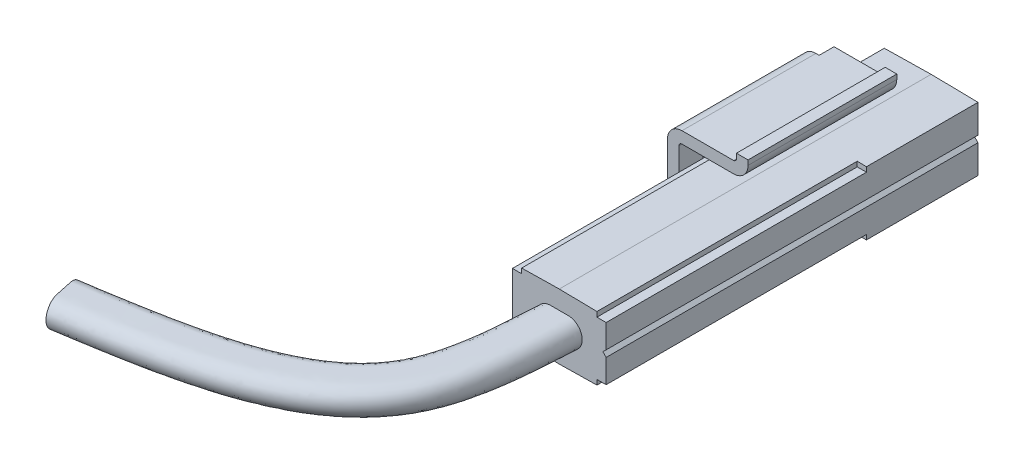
ISO-10303-21;
HEADER;
FILE_DESCRIPTION(('STEP AP214'),'2;1');
FILE_NAME('part.step','',(''),(''),'','','');
FILE_SCHEMA(('AUTOMOTIVE_DESIGN { 1 0 10303 214 1 1 1 1 }'));
ENDSEC;
DATA;
#1=APPLICATION_CONTEXT('core data for automotive mechanical design processes');
#2=APPLICATION_PROTOCOL_DEFINITION('international standard','automotive_design',2000,#1);
#3=PRODUCT_CONTEXT('',#1,'mechanical');
#4=PRODUCT('Part','Part','',(#3));
#5=PRODUCT_RELATED_PRODUCT_CATEGORY('part','',(#4));
#6=PRODUCT_DEFINITION_FORMATION('','',#4);
#7=PRODUCT_DEFINITION_CONTEXT('part definition',#1,'design');
#8=PRODUCT_DEFINITION('design','',#6,#7);
#9=PRODUCT_DEFINITION_SHAPE('','',#8);
#10=(LENGTH_UNIT() NAMED_UNIT(*) SI_UNIT(.MILLI.,.METRE.));
#11=(NAMED_UNIT(*) PLANE_ANGLE_UNIT() SI_UNIT($,.RADIAN.));
#12=(NAMED_UNIT(*) SI_UNIT($,.STERADIAN.) SOLID_ANGLE_UNIT());
#13=UNCERTAINTY_MEASURE_WITH_UNIT(LENGTH_MEASURE(1.E-05),#10,'distance_accuracy_value','');
#14=(GEOMETRIC_REPRESENTATION_CONTEXT(3) GLOBAL_UNCERTAINTY_ASSIGNED_CONTEXT((#13)) GLOBAL_UNIT_ASSIGNED_CONTEXT((#10,
#11,#12)) REPRESENTATION_CONTEXT('',''));
#15=CARTESIAN_POINT('',(0.,0.,0.));
#16=DIRECTION('',(0.,0.,1.));
#17=DIRECTION('',(1.,0.,0.));
#18=AXIS2_PLACEMENT_3D('',#15,#16,#17);
#19=CARTESIAN_POINT('',(-2.9718,0.,0.));
#20=DIRECTION('',(-1.,0.,0.));
#21=DIRECTION('',(0.,0.,1.));
#22=AXIS2_PLACEMENT_3D('',#19,#20,#21);
#23=CONICAL_SURFACE('',#22,0.7747,0.785398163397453);
#24=CARTESIAN_POINT('',(-3.40360000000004,0.,0.));
#25=DIRECTION('',(-1.,0.,0.));
#26=DIRECTION('',(0.,0.,1.));
#27=AXIS2_PLACEMENT_3D('',#24,#25,#26);
#28=CIRCLE('',#27,1.20650000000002);
#29=CARTESIAN_POINT('',(-3.40360000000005,0.,1.20650000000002));
#30=VERTEX_POINT('',#29);
#31=EDGE_CURVE('E857',#30,#30,#28,.F.);
#32=ORIENTED_EDGE('',*,*,#31,.T.);
#33=EDGE_LOOP('',(#32));
#34=FACE_BOUND('',#33,.T.);
#35=CARTESIAN_POINT('',(-3.2512,0.,0.));
#36=DIRECTION('',(1.,0.,0.));
#37=DIRECTION('',(0.,0.,-1.));
#38=AXIS2_PLACEMENT_3D('',#35,#36,#37);
#39=CIRCLE('',#38,1.05409999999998);
#40=CARTESIAN_POINT('',(-3.2512,0.,-1.05409999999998));
#41=VERTEX_POINT('',#40);
#42=EDGE_CURVE('E19',#41,#41,#39,.F.);
#43=ORIENTED_EDGE('',*,*,#42,.T.);
#44=EDGE_LOOP('',(#43));
#45=FACE_BOUND('',#44,.T.);
#46=ADVANCED_FACE('F15',(#34,#45),#23,.T.);
#47=CARTESIAN_POINT('',(-3.2512,2.7075774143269,22.225));
#48=DIRECTION('',(1.,0.,0.));
#49=DIRECTION('',(0.,0.,-1.));
#50=AXIS2_PLACEMENT_3D('',#47,#48,#49);
#51=PLANE('',#50);
#52=ORIENTED_EDGE('',*,*,#42,.F.);
#53=EDGE_LOOP('',(#52));
#54=FACE_BOUND('',#53,.T.);
#55=DIRECTION('',(0.,1.,0.));
#56=VECTOR('',#55,1.);
#57=CARTESIAN_POINT('',(-3.2512,-3.39302569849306,0.));
#58=LINE('',#57,#56);
#59=CARTESIAN_POINT('',(-3.2512,-2.7075774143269,0.));
#60=VERTEX_POINT('',#59);
#61=CARTESIAN_POINT('',(-3.2512,-2.3011774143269,0.));
#62=VERTEX_POINT('',#61);
#63=EDGE_CURVE('E679',#60,#62,#58,.T.);
#64=ORIENTED_EDGE('',*,*,#63,.T.);
#65=DIRECTION('',(0.,0.,1.));
#66=VECTOR('',#65,1.);
#67=CARTESIAN_POINT('',(-3.2512,-2.3011774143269,0.));
#68=LINE('',#67,#66);
#69=CARTESIAN_POINT('',(-3.2512,-2.3011774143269,22.225));
#70=VERTEX_POINT('',#69);
#71=EDGE_CURVE('E690',#62,#70,#68,.T.);
#72=ORIENTED_EDGE('',*,*,#71,.T.);
#73=DIRECTION('',(0.,-1.,0.));
#74=VECTOR('',#73,1.);
#75=CARTESIAN_POINT('',(-3.2512,2.7075774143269,22.225));
#76=LINE('',#75,#74);
#77=CARTESIAN_POINT('',(-3.2512,2.3011774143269,22.225));
#78=VERTEX_POINT('',#77);
#79=EDGE_CURVE('E767',#78,#70,#76,.T.);
#80=ORIENTED_EDGE('',*,*,#79,.F.);
#81=DIRECTION('',(0.,0.,1.));
#82=VECTOR('',#81,1.);
#83=CARTESIAN_POINT('',(-3.2512,2.3011774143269,0.));
#84=LINE('',#83,#82);
#85=CARTESIAN_POINT('',(-3.2512,2.3011774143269,0.));
#86=VERTEX_POINT('',#85);
#87=EDGE_CURVE('E722',#86,#78,#84,.T.);
#88=ORIENTED_EDGE('',*,*,#87,.F.);
#89=DIRECTION('',(0.,1.,0.));
#90=VECTOR('',#89,1.);
#91=CARTESIAN_POINT('',(-3.2512,2.7075774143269,0.));
#92=LINE('',#91,#90);
#93=CARTESIAN_POINT('',(-3.2512,2.7075774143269,0.));
#94=VERTEX_POINT('',#93);
#95=EDGE_CURVE('E805',#86,#94,#92,.T.);
#96=ORIENTED_EDGE('',*,*,#95,.T.);
#97=DIRECTION('',(0.,0.,-1.));
#98=VECTOR('',#97,1.);
#99=CARTESIAN_POINT('',(-3.2512,2.7075774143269,22.225));
#100=LINE('',#99,#98);
#101=CARTESIAN_POINT('',(-3.2512,2.7075774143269,-9.525));
#102=VERTEX_POINT('',#101);
#103=EDGE_CURVE('E796',#94,#102,#100,.T.);
#104=ORIENTED_EDGE('',*,*,#103,.T.);
#105=DIRECTION('',(0.,-1.,0.));
#106=VECTOR('',#105,1.);
#107=CARTESIAN_POINT('',(-3.2512,2.7075774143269,-9.525));
#108=LINE('',#107,#106);
#109=CARTESIAN_POINT('',(-3.2512,-2.7075774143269,-9.525));
#110=VERTEX_POINT('',#109);
#111=EDGE_CURVE('E751',#102,#110,#108,.T.);
#112=ORIENTED_EDGE('',*,*,#111,.T.);
#113=DIRECTION('',(0.,0.,-1.));
#114=VECTOR('',#113,1.);
#115=CARTESIAN_POINT('',(-3.2512,-2.7075774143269,22.225));
#116=LINE('',#115,#114);
#117=EDGE_CURVE('E793',#60,#110,#116,.T.);
#118=ORIENTED_EDGE('',*,*,#117,.F.);
#119=EDGE_LOOP('',(#64,#72,#80,#88,#96,#104,#112,#118));
#120=FACE_BOUND('',#119,.T.);
#121=ADVANCED_FACE('F865',(#54,#120),#51,.F.);
#122=CARTESIAN_POINT('',(-3.2512,-2.3011774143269,0.));
#123=DIRECTION('',(0.,0.,1.));
#124=DIRECTION('',(1.,0.,0.));
#125=AXIS2_PLACEMENT_3D('',#122,#123,#124);
#126=PLANE('',#125);
#127=DIRECTION('',(0.,-1.,0.));
#128=VECTOR('',#127,1.);
#129=CARTESIAN_POINT('',(-2.4638,-2.3011774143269,0.));
#130=LINE('',#129,#128);
#131=CARTESIAN_POINT('',(-2.4638,-2.3011774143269,0.));
#132=VERTEX_POINT('',#131);
#133=CARTESIAN_POINT('',(-2.4638,-2.72132153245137,0.));
#134=VERTEX_POINT('',#133);
#135=EDGE_CURVE('E685',#132,#134,#130,.T.);
#136=ORIENTED_EDGE('',*,*,#135,.F.);
#137=DIRECTION('',(-1.,0.,0.));
#138=VECTOR('',#137,1.);
#139=CARTESIAN_POINT('',(-2.4638,-2.3011774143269,0.));
#140=LINE('',#139,#138);
#141=EDGE_CURVE('E682',#132,#62,#140,.T.);
#142=ORIENTED_EDGE('',*,*,#141,.T.);
#143=ORIENTED_EDGE('',*,*,#63,.F.);
#144=DIRECTION('',(-0.999847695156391,0.017452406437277,0.));
#145=VECTOR('',#144,1.);
#146=CARTESIAN_POINT('',(0.7493,-2.77740640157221,0.));
#147=LINE('',#146,#145);
#148=EDGE_CURVE('E817',#134,#60,#147,.T.);
#149=ORIENTED_EDGE('',*,*,#148,.F.);
#150=EDGE_LOOP('',(#136,#142,#143,#149));
#151=FACE_BOUND('',#150,.T.);
#152=ADVANCED_FACE('F868',(#151),#126,.T.);
#153=CARTESIAN_POINT('',(-2.4638,-2.3011774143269,0.));
#154=DIRECTION('',(0.,1.,0.));
#155=DIRECTION('',(0.,0.,1.));
#156=AXIS2_PLACEMENT_3D('',#153,#154,#155);
#157=PLANE('',#156);
#158=DIRECTION('',(-1.,0.,0.));
#159=VECTOR('',#158,1.);
#160=CARTESIAN_POINT('',(-2.4638,-2.3011774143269,22.225));
#161=LINE('',#160,#159);
#162=CARTESIAN_POINT('',(-2.4638,-2.3011774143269,22.225));
#163=VERTEX_POINT('',#162);
#164=EDGE_CURVE('E674',#163,#70,#161,.T.);
#165=ORIENTED_EDGE('',*,*,#164,.T.);
#166=ORIENTED_EDGE('',*,*,#71,.F.);
#167=ORIENTED_EDGE('',*,*,#141,.F.);
#168=DIRECTION('',(0.,0.,1.));
#169=VECTOR('',#168,1.);
#170=CARTESIAN_POINT('',(-2.4638,-2.3011774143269,0.));
#171=LINE('',#170,#169);
#172=EDGE_CURVE('E688',#132,#163,#171,.T.);
#173=ORIENTED_EDGE('',*,*,#172,.T.);
#174=EDGE_LOOP('',(#165,#166,#167,#173));
#175=FACE_BOUND('',#174,.T.);
#176=ADVANCED_FACE('F887',(#175),#157,.F.);
#177=CARTESIAN_POINT('',(-2.4638,2.3011774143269,0.));
#178=DIRECTION('',(0.,1.,0.));
#179=DIRECTION('',(0.,0.,1.));
#180=AXIS2_PLACEMENT_3D('',#177,#178,#179);
#181=PLANE('',#180);
#182=DIRECTION('',(-1.,0.,0.));
#183=VECTOR('',#182,1.);
#184=CARTESIAN_POINT('',(-2.4638,2.3011774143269,22.225));
#185=LINE('',#184,#183);
#186=CARTESIAN_POINT('',(-2.4638,2.3011774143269,22.225));
#187=VERTEX_POINT('',#186);
#188=EDGE_CURVE('E711',#187,#78,#185,.T.);
#189=ORIENTED_EDGE('',*,*,#188,.F.);
#190=DIRECTION('',(0.,0.,1.));
#191=VECTOR('',#190,1.);
#192=CARTESIAN_POINT('',(-2.4638,2.3011774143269,0.));
#193=LINE('',#192,#191);
#194=CARTESIAN_POINT('',(-2.4638,2.3011774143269,0.));
#195=VERTEX_POINT('',#194);
#196=EDGE_CURVE('E723',#195,#187,#193,.T.);
#197=ORIENTED_EDGE('',*,*,#196,.F.);
#198=DIRECTION('',(-1.,0.,0.));
#199=VECTOR('',#198,1.);
#200=CARTESIAN_POINT('',(-2.4638,2.3011774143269,0.));
#201=LINE('',#200,#199);
#202=EDGE_CURVE('E716',#195,#86,#201,.T.);
#203=ORIENTED_EDGE('',*,*,#202,.T.);
#204=ORIENTED_EDGE('',*,*,#87,.T.);
#205=EDGE_LOOP('',(#189,#197,#203,#204));
#206=FACE_BOUND('',#205,.T.);
#207=ADVANCED_FACE('F889',(#206),#181,.T.);
#208=CARTESIAN_POINT('',(-3.2512,2.3011774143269,0.));
#209=DIRECTION('',(0.,0.,-1.));
#210=DIRECTION('',(-1.,0.,0.));
#211=AXIS2_PLACEMENT_3D('',#208,#209,#210);
#212=PLANE('',#211);
#213=ORIENTED_EDGE('',*,*,#95,.F.);
#214=ORIENTED_EDGE('',*,*,#202,.F.);
#215=DIRECTION('',(0.,1.,0.));
#216=VECTOR('',#215,1.);
#217=CARTESIAN_POINT('',(-2.4638,2.3011774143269,0.));
#218=LINE('',#217,#216);
#219=CARTESIAN_POINT('',(-2.4638,2.72132153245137,0.));
#220=VERTEX_POINT('',#219);
#221=EDGE_CURVE('E719',#195,#220,#218,.T.);
#222=ORIENTED_EDGE('',*,*,#221,.T.);
#223=DIRECTION('',(0.999847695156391,0.0174524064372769,0.));
#224=VECTOR('',#223,1.);
#225=CARTESIAN_POINT('',(0.7493,2.77740640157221,0.));
#226=LINE('',#225,#224);
#227=EDGE_CURVE('E725',#94,#220,#226,.T.);
#228=ORIENTED_EDGE('',*,*,#227,.F.);
#229=EDGE_LOOP('',(#213,#214,#222,#228));
#230=FACE_BOUND('',#229,.T.);
#231=ADVANCED_FACE('F896',(#230),#212,.F.);
#232=CARTESIAN_POINT('',(0.7493,2.77740640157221,22.225));
#233=DIRECTION('',(0.0174524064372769,-0.999847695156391,0.));
#234=DIRECTION('',(0.999847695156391,0.0174524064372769,0.));
#235=AXIS2_PLACEMENT_3D('',#232,#233,#234);
#236=PLANE('',#235);
#237=ORIENTED_EDGE('',*,*,#227,.T.);
#238=DIRECTION('',(0.,0.,1.));
#239=VECTOR('',#238,1.);
#240=CARTESIAN_POINT('',(-2.4638,2.72132153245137,22.225));
#241=LINE('',#240,#239);
#242=CARTESIAN_POINT('',(-2.4638,2.72132153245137,22.225));
#243=VERTEX_POINT('',#242);
#244=EDGE_CURVE('E808',#220,#243,#241,.T.);
#245=ORIENTED_EDGE('',*,*,#244,.T.);
#246=DIRECTION('',(-0.999847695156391,-0.0174524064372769,0.));
#247=VECTOR('',#246,1.);
#248=CARTESIAN_POINT('',(0.7493,2.77740640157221,22.225));
#249=LINE('',#248,#247);
#250=CARTESIAN_POINT('',(0.7493,2.77740640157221,22.225));
#251=VERTEX_POINT('',#250);
#252=EDGE_CURVE('E764',#251,#243,#249,.T.);
#253=ORIENTED_EDGE('',*,*,#252,.F.);
#254=DIRECTION('',(0.,0.,-1.));
#255=VECTOR('',#254,1.);
#256=CARTESIAN_POINT('',(0.7493,2.77740640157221,22.225));
#257=LINE('',#256,#255);
#258=CARTESIAN_POINT('',(0.7493,2.77740640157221,-9.525));
#259=VERTEX_POINT('',#258);
#260=EDGE_CURVE('E783',#251,#259,#257,.T.);
#261=ORIENTED_EDGE('',*,*,#260,.T.);
#262=DIRECTION('',(-0.999847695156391,-0.0174524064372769,0.));
#263=VECTOR('',#262,1.);
#264=CARTESIAN_POINT('',(0.7493,2.77740640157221,-9.525));
#265=LINE('',#264,#263);
#266=EDGE_CURVE('E749',#259,#102,#265,.T.);
#267=ORIENTED_EDGE('',*,*,#266,.T.);
#268=ORIENTED_EDGE('',*,*,#103,.F.);
#269=EDGE_LOOP('',(#237,#245,#253,#261,#267,#268));
#270=FACE_BOUND('',#269,.T.);
#271=ADVANCED_FACE('F975',(#270),#236,.F.);
#272=CARTESIAN_POINT('',(4.7498,2.84723538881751,-9.525));
#273=DIRECTION('',(0.,0.,-1.));
#274=DIRECTION('',(-1.,0.,0.));
#275=AXIS2_PLACEMENT_3D('',#272,#273,#274);
#276=PLANE('',#275);
#277=DIRECTION('',(0.999847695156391,-0.0174524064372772,0.));
#278=VECTOR('',#277,1.);
#279=CARTESIAN_POINT('',(0.7493,2.77740640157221,-9.525));
#280=LINE('',#279,#278);
#281=CARTESIAN_POINT('',(4.7498,2.7075774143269,-9.525));
#282=VERTEX_POINT('',#281);
#283=EDGE_CURVE('E761',#259,#282,#280,.T.);
#284=ORIENTED_EDGE('',*,*,#283,.T.);
#285=DIRECTION('',(0.,1.,0.));
#286=VECTOR('',#285,1.);
#287=CARTESIAN_POINT('',(4.7498,-2.7075774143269,-9.525));
#288=LINE('',#287,#286);
#289=CARTESIAN_POINT('',(4.7498,0.2794,-9.525));
#290=VERTEX_POINT('',#289);
#291=EDGE_CURVE('E758',#290,#282,#288,.T.);
#292=ORIENTED_EDGE('',*,*,#291,.F.);
#293=DIRECTION('',(0.707106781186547,0.707106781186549,0.));
#294=VECTOR('',#293,1.);
#295=CARTESIAN_POINT('',(6.03371769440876,1.56331769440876,-9.525));
#296=LINE('',#295,#294);
#297=CARTESIAN_POINT('',(4.4704,0.,-9.525));
#298=VERTEX_POINT('',#297);
#299=EDGE_CURVE('E823',#298,#290,#296,.T.);
#300=ORIENTED_EDGE('',*,*,#299,.F.);
#301=DIRECTION('',(-0.707106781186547,0.707106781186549,0.));
#302=VECTOR('',#301,1.);
#303=CARTESIAN_POINT('',(3.18648230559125,1.28391769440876,-9.525));
#304=LINE('',#303,#302);
#305=CARTESIAN_POINT('',(4.7498,-0.2794,-9.525));
#306=VERTEX_POINT('',#305);
#307=EDGE_CURVE('E658',#306,#298,#304,.T.);
#308=ORIENTED_EDGE('',*,*,#307,.F.);
#309=CARTESIAN_POINT('',(4.7498,-2.7075774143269,-9.525));
#310=VERTEX_POINT('',#309);
#311=EDGE_CURVE('E759',#310,#306,#288,.T.);
#312=ORIENTED_EDGE('',*,*,#311,.F.);
#313=DIRECTION('',(0.999847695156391,0.0174524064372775,0.));
#314=VECTOR('',#313,1.);
#315=CARTESIAN_POINT('',(0.7493,-2.77740640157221,-9.525));
#316=LINE('',#315,#314);
#317=CARTESIAN_POINT('',(0.7493,-2.77740640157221,-9.525));
#318=VERTEX_POINT('',#317);
#319=EDGE_CURVE('E756',#318,#310,#316,.T.);
#320=ORIENTED_EDGE('',*,*,#319,.F.);
#321=DIRECTION('',(-0.999847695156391,0.017452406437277,0.));
#322=VECTOR('',#321,1.);
#323=CARTESIAN_POINT('',(0.7493,-2.77740640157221,-9.525));
#324=LINE('',#323,#322);
#325=EDGE_CURVE('E753',#318,#110,#324,.T.);
#326=ORIENTED_EDGE('',*,*,#325,.T.);
#327=ORIENTED_EDGE('',*,*,#111,.F.);
#328=ORIENTED_EDGE('',*,*,#266,.F.);
#329=EDGE_LOOP('',(#284,#292,#300,#308,#312,#320,#326,#327,#328));
#330=FACE_BOUND('',#329,.T.);
#331=ADVANCED_FACE('F970',(#330),#276,.T.);
#332=CARTESIAN_POINT('',(0.7493,-2.77740640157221,22.225));
#333=DIRECTION('',(-0.017452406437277,-0.999847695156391,0.));
#334=DIRECTION('',(0.999847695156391,-0.017452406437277,0.));
#335=AXIS2_PLACEMENT_3D('',#332,#333,#334);
#336=PLANE('',#335);
#337=ORIENTED_EDGE('',*,*,#117,.T.);
#338=ORIENTED_EDGE('',*,*,#325,.F.);
#339=DIRECTION('',(0.,0.,-1.));
#340=VECTOR('',#339,1.);
#341=CARTESIAN_POINT('',(0.7493,-2.77740640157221,22.225));
#342=LINE('',#341,#340);
#343=CARTESIAN_POINT('',(0.7493,-2.77740640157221,22.225));
#344=VERTEX_POINT('',#343);
#345=EDGE_CURVE('E791',#344,#318,#342,.T.);
#346=ORIENTED_EDGE('',*,*,#345,.F.);
#347=DIRECTION('',(-0.999847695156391,0.017452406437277,0.));
#348=VECTOR('',#347,1.);
#349=CARTESIAN_POINT('',(0.7493,-2.77740640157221,22.225));
#350=LINE('',#349,#348);
#351=CARTESIAN_POINT('',(-2.4638,-2.72132153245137,22.225));
#352=VERTEX_POINT('',#351);
#353=EDGE_CURVE('E770',#344,#352,#350,.T.);
#354=ORIENTED_EDGE('',*,*,#353,.T.);
#355=DIRECTION('',(0.,0.,-1.));
#356=VECTOR('',#355,1.);
#357=CARTESIAN_POINT('',(-2.4638,-2.72132153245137,22.225));
#358=LINE('',#357,#356);
#359=EDGE_CURVE('E820',#352,#134,#358,.T.);
#360=ORIENTED_EDGE('',*,*,#359,.T.);
#361=ORIENTED_EDGE('',*,*,#148,.T.);
#362=EDGE_LOOP('',(#337,#338,#346,#354,#360,#361));
#363=FACE_BOUND('',#362,.T.);
#364=ADVANCED_FACE('F877',(#363),#336,.T.);
#365=CARTESIAN_POINT('',(-2.4638,-2.3011774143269,0.));
#366=DIRECTION('',(-1.,0.,0.));
#367=DIRECTION('',(0.,-1.,0.));
#368=AXIS2_PLACEMENT_3D('',#365,#366,#367);
#369=PLANE('',#368);
#370=DIRECTION('',(0.,-1.,0.));
#371=VECTOR('',#370,1.);
#372=CARTESIAN_POINT('',(-2.4638,-2.3011774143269,22.225));
#373=LINE('',#372,#371);
#374=EDGE_CURVE('E676',#163,#352,#373,.T.);
#375=ORIENTED_EDGE('',*,*,#374,.F.);
#376=ORIENTED_EDGE('',*,*,#172,.F.);
#377=ORIENTED_EDGE('',*,*,#135,.T.);
#378=ORIENTED_EDGE('',*,*,#359,.F.);
#379=EDGE_LOOP('',(#375,#376,#377,#378));
#380=FACE_BOUND('',#379,.T.);
#381=ADVANCED_FACE('F882',(#380),#369,.T.);
#382=CARTESIAN_POINT('',(4.7498,2.84723538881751,22.225));
#383=DIRECTION('',(0.,0.,-1.));
#384=DIRECTION('',(-1.,0.,0.));
#385=AXIS2_PLACEMENT_3D('',#382,#383,#384);
#386=PLANE('',#385);
#387=CARTESIAN_POINT('',(-0.0126999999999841,0.,22.225));
#388=DIRECTION('',(0.,0.,1.));
#389=DIRECTION('',(1.,0.,0.));
#390=AXIS2_PLACEMENT_3D('',#387,#388,#389);
#391=CIRCLE('',#390,1.1938);
#392=CARTESIAN_POINT('',(-0.012699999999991,1.1938,22.225));
#393=VERTEX_POINT('',#392);
#394=CARTESIAN_POINT('',(-0.0126999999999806,-1.1938,22.225));
#395=VERTEX_POINT('',#394);
#396=EDGE_CURVE('E649',#393,#395,#391,.T.);
#397=ORIENTED_EDGE('',*,*,#396,.F.);
#398=DIRECTION('',(-1.,0.,0.));
#399=VECTOR('',#398,1.);
#400=CARTESIAN_POINT('',(-0.012699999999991,1.1938,22.225));
#401=LINE('',#400,#399);
#402=CARTESIAN_POINT('',(1.5113,1.1938,22.225));
#403=VERTEX_POINT('',#402);
#404=EDGE_CURVE('E653',#403,#393,#401,.T.);
#405=ORIENTED_EDGE('',*,*,#404,.F.);
#406=CARTESIAN_POINT('',(1.5113,0.,22.225));
#407=DIRECTION('',(0.,0.,1.));
#408=DIRECTION('',(1.,0.,0.));
#409=AXIS2_PLACEMENT_3D('',#406,#407,#408);
#410=CIRCLE('',#409,1.1938);
#411=CARTESIAN_POINT('',(1.5113,-1.1938,22.225));
#412=VERTEX_POINT('',#411);
#413=EDGE_CURVE('E657',#412,#403,#410,.T.);
#414=ORIENTED_EDGE('',*,*,#413,.F.);
#415=DIRECTION('',(1.,0.,0.));
#416=VECTOR('',#415,1.);
#417=CARTESIAN_POINT('',(-0.0126999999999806,-1.1938,22.225));
#418=LINE('',#417,#416);
#419=EDGE_CURVE('E654',#395,#412,#418,.T.);
#420=ORIENTED_EDGE('',*,*,#419,.F.);
#421=EDGE_LOOP('',(#397,#405,#414,#420));
#422=FACE_BOUND('',#421,.T.);
#423=DIRECTION('',(0.,1.,0.));
#424=VECTOR('',#423,1.);
#425=CARTESIAN_POINT('',(4.7498,-2.7075774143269,22.225));
#426=LINE('',#425,#424);
#427=CARTESIAN_POINT('',(4.7498,-2.3011774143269,22.225));
#428=VERTEX_POINT('',#427);
#429=CARTESIAN_POINT('',(4.7498,-0.2794,22.225));
#430=VERTEX_POINT('',#429);
#431=EDGE_CURVE('E777',#428,#430,#426,.T.);
#432=ORIENTED_EDGE('',*,*,#431,.T.);
#433=DIRECTION('',(-0.707106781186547,0.707106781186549,0.));
#434=VECTOR('',#433,1.);
#435=CARTESIAN_POINT('',(3.18648230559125,1.28391769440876,22.225));
#436=LINE('',#435,#434);
#437=CARTESIAN_POINT('',(4.4704,0.,22.225));
#438=VERTEX_POINT('',#437);
#439=EDGE_CURVE('E672',#430,#438,#436,.T.);
#440=ORIENTED_EDGE('',*,*,#439,.T.);
#441=DIRECTION('',(0.707106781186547,0.707106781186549,0.));
#442=VECTOR('',#441,1.);
#443=CARTESIAN_POINT('',(6.03371769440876,1.56331769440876,22.225));
#444=LINE('',#443,#442);
#445=CARTESIAN_POINT('',(4.7498,0.2794,22.225));
#446=VERTEX_POINT('',#445);
#447=EDGE_CURVE('E668',#438,#446,#444,.T.);
#448=ORIENTED_EDGE('',*,*,#447,.T.);
#449=CARTESIAN_POINT('',(4.7498,2.3011774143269,22.225));
#450=VERTEX_POINT('',#449);
#451=EDGE_CURVE('E776',#446,#450,#426,.T.);
#452=ORIENTED_EDGE('',*,*,#451,.T.);
#453=DIRECTION('',(1.,0.,0.));
#454=VECTOR('',#453,1.);
#455=CARTESIAN_POINT('',(3.9624,2.3011774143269,22.225));
#456=LINE('',#455,#454);
#457=CARTESIAN_POINT('',(3.9624,2.3011774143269,22.225));
#458=VERTEX_POINT('',#457);
#459=EDGE_CURVE('E729',#458,#450,#456,.T.);
#460=ORIENTED_EDGE('',*,*,#459,.F.);
#461=DIRECTION('',(0.,1.,0.));
#462=VECTOR('',#461,1.);
#463=CARTESIAN_POINT('',(3.9624,2.3011774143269,22.225));
#464=LINE('',#463,#462);
#465=CARTESIAN_POINT('',(3.9624,2.72132153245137,22.225));
#466=VERTEX_POINT('',#465);
#467=EDGE_CURVE('E732',#458,#466,#464,.T.);
#468=ORIENTED_EDGE('',*,*,#467,.T.);
#469=DIRECTION('',(0.999847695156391,-0.0174524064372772,0.));
#470=VECTOR('',#469,1.);
#471=CARTESIAN_POINT('',(0.7493,2.77740640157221,22.225));
#472=LINE('',#471,#470);
#473=EDGE_CURVE('E780',#251,#466,#472,.T.);
#474=ORIENTED_EDGE('',*,*,#473,.F.);
#475=ORIENTED_EDGE('',*,*,#252,.T.);
#476=DIRECTION('',(0.,1.,0.));
#477=VECTOR('',#476,1.);
#478=CARTESIAN_POINT('',(-2.4638,2.3011774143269,22.225));
#479=LINE('',#478,#477);
#480=EDGE_CURVE('E714',#187,#243,#479,.T.);
#481=ORIENTED_EDGE('',*,*,#480,.F.);
#482=ORIENTED_EDGE('',*,*,#188,.T.);
#483=ORIENTED_EDGE('',*,*,#79,.T.);
#484=ORIENTED_EDGE('',*,*,#164,.F.);
#485=ORIENTED_EDGE('',*,*,#374,.T.);
#486=ORIENTED_EDGE('',*,*,#353,.F.);
#487=DIRECTION('',(0.999847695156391,0.0174524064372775,0.));
#488=VECTOR('',#487,1.);
#489=CARTESIAN_POINT('',(0.7493,-2.77740640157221,22.225));
#490=LINE('',#489,#488);
#491=CARTESIAN_POINT('',(3.9624,-2.72132153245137,22.225));
#492=VERTEX_POINT('',#491);
#493=EDGE_CURVE('E773',#344,#492,#490,.T.);
#494=ORIENTED_EDGE('',*,*,#493,.T.);
#495=DIRECTION('',(0.,-1.,0.));
#496=VECTOR('',#495,1.);
#497=CARTESIAN_POINT('',(3.9624,-2.3011774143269,22.225));
#498=LINE('',#497,#496);
#499=CARTESIAN_POINT('',(3.9624,-2.3011774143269,22.225));
#500=VERTEX_POINT('',#499);
#501=EDGE_CURVE('E696',#500,#492,#498,.T.);
#502=ORIENTED_EDGE('',*,*,#501,.F.);
#503=DIRECTION('',(1.,0.,0.));
#504=VECTOR('',#503,1.);
#505=CARTESIAN_POINT('',(3.9624,-2.3011774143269,22.225));
#506=LINE('',#505,#504);
#507=EDGE_CURVE('E693',#500,#428,#506,.T.);
#508=ORIENTED_EDGE('',*,*,#507,.T.);
#509=EDGE_LOOP('',(#432,#440,#448,#452,#460,#468,#474,#475,#481,#482,#483,#484,#485,#486,#494,
#502,#508));
#510=FACE_BOUND('',#509,.T.);
#511=ADVANCED_FACE('F885',(#422,#510),#386,.F.);
#512=CARTESIAN_POINT('',(4.7498,-2.7075774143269,22.225));
#513=DIRECTION('',(-1.,0.,0.));
#514=DIRECTION('',(0.,0.,1.));
#515=AXIS2_PLACEMENT_3D('',#512,#513,#514);
#516=PLANE('',#515);
#517=ORIENTED_EDGE('',*,*,#311,.T.);
#518=DIRECTION('',(0.,0.,-1.));
#519=VECTOR('',#518,1.);
#520=CARTESIAN_POINT('',(4.7498,-0.2794,98.3455711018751));
#521=LINE('',#520,#519);
#522=EDGE_CURVE('E665',#430,#306,#521,.T.);
#523=ORIENTED_EDGE('',*,*,#522,.F.);
#524=ORIENTED_EDGE('',*,*,#431,.F.);
#525=DIRECTION('',(0.,0.,1.));
#526=VECTOR('',#525,1.);
#527=CARTESIAN_POINT('',(4.7498,-2.3011774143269,0.));
#528=LINE('',#527,#526);
#529=CARTESIAN_POINT('',(4.7498,-2.3011774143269,0.));
#530=VERTEX_POINT('',#529);
#531=EDGE_CURVE('E704',#530,#428,#528,.T.);
#532=ORIENTED_EDGE('',*,*,#531,.F.);
#533=DIRECTION('',(0.,-1.,0.));
#534=VECTOR('',#533,1.);
#535=CARTESIAN_POINT('',(4.7498,-2.7075774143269,0.));
#536=LINE('',#535,#534);
#537=CARTESIAN_POINT('',(4.7498,-2.7075774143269,0.));
#538=VERTEX_POINT('',#537);
#539=EDGE_CURVE('E811',#530,#538,#536,.T.);
#540=ORIENTED_EDGE('',*,*,#539,.T.);
#541=DIRECTION('',(0.,0.,-1.));
#542=VECTOR('',#541,1.);
#543=CARTESIAN_POINT('',(4.7498,-2.7075774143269,22.225));
#544=LINE('',#543,#542);
#545=EDGE_CURVE('E788',#538,#310,#544,.T.);
#546=ORIENTED_EDGE('',*,*,#545,.T.);
#547=EDGE_LOOP('',(#517,#523,#524,#532,#540,#546));
#548=FACE_BOUND('',#547,.T.);
#549=ADVANCED_FACE('F961',(#548),#516,.F.);
#550=CARTESIAN_POINT('',(4.4704,0.,98.3455711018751));
#551=DIRECTION('',(-0.707106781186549,-0.707106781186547,0.));
#552=DIRECTION('',(0.707106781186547,-0.707106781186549,0.));
#553=AXIS2_PLACEMENT_3D('',#550,#551,#552);
#554=PLANE('',#553);
#555=ORIENTED_EDGE('',*,*,#439,.F.);
#556=ORIENTED_EDGE('',*,*,#522,.T.);
#557=ORIENTED_EDGE('',*,*,#307,.T.);
#558=DIRECTION('',(0.,0.,-1.));
#559=VECTOR('',#558,1.);
#560=CARTESIAN_POINT('',(4.4704,0.,98.3455711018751));
#561=LINE('',#560,#559);
#562=EDGE_CURVE('E648',#438,#298,#561,.T.);
#563=ORIENTED_EDGE('',*,*,#562,.F.);
#564=EDGE_LOOP('',(#555,#556,#557,#563));
#565=FACE_BOUND('',#564,.T.);
#566=ADVANCED_FACE('F958',(#565),#554,.F.);
#567=CARTESIAN_POINT('',(4.4704,0.,98.3455711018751));
#568=DIRECTION('',(-0.707106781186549,0.707106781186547,0.));
#569=DIRECTION('',(-0.707106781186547,-0.707106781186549,0.));
#570=AXIS2_PLACEMENT_3D('',#567,#568,#569);
#571=PLANE('',#570);
#572=ORIENTED_EDGE('',*,*,#447,.F.);
#573=ORIENTED_EDGE('',*,*,#562,.T.);
#574=ORIENTED_EDGE('',*,*,#299,.T.);
#575=DIRECTION('',(0.,0.,-1.));
#576=VECTOR('',#575,1.);
#577=CARTESIAN_POINT('',(4.7498,0.2794,98.3455711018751));
#578=LINE('',#577,#576);
#579=EDGE_CURVE('E662',#446,#290,#578,.T.);
#580=ORIENTED_EDGE('',*,*,#579,.F.);
#581=EDGE_LOOP('',(#572,#573,#574,#580));
#582=FACE_BOUND('',#581,.T.);
#583=ADVANCED_FACE('F949',(#582),#571,.F.);
#584=DIRECTION('',(0.,-1.,0.));
#585=VECTOR('',#584,1.);
#586=CARTESIAN_POINT('',(4.7498,3.16555730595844,0.));
#587=LINE('',#586,#585);
#588=CARTESIAN_POINT('',(4.7498,2.7075774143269,0.));
#589=VERTEX_POINT('',#588);
#590=CARTESIAN_POINT('',(4.7498,2.3011774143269,0.));
#591=VERTEX_POINT('',#590);
#592=EDGE_CURVE('E735',#589,#591,#587,.T.);
#593=ORIENTED_EDGE('',*,*,#592,.T.);
#594=DIRECTION('',(0.,0.,1.));
#595=VECTOR('',#594,1.);
#596=CARTESIAN_POINT('',(4.7498,2.3011774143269,0.));
#597=LINE('',#596,#595);
#598=EDGE_CURVE('E746',#591,#450,#597,.T.);
#599=ORIENTED_EDGE('',*,*,#598,.T.);
#600=ORIENTED_EDGE('',*,*,#451,.F.);
#601=ORIENTED_EDGE('',*,*,#579,.T.);
#602=ORIENTED_EDGE('',*,*,#291,.T.);
#603=DIRECTION('',(0.,0.,-1.));
#604=VECTOR('',#603,1.);
#605=CARTESIAN_POINT('',(4.7498,2.7075774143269,22.225));
#606=LINE('',#605,#604);
#607=EDGE_CURVE('E785',#589,#282,#606,.T.);
#608=ORIENTED_EDGE('',*,*,#607,.F.);
#609=EDGE_LOOP('',(#593,#599,#600,#601,#602,#608));
#610=FACE_BOUND('',#609,.T.);
#611=ADVANCED_FACE('F957',(#610),#516,.F.);
#612=CARTESIAN_POINT('',(3.9624,2.3011774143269,0.));
#613=DIRECTION('',(0.,-1.,0.));
#614=DIRECTION('',(0.,0.,-1.));
#615=AXIS2_PLACEMENT_3D('',#612,#613,#614);
#616=PLANE('',#615);
#617=ORIENTED_EDGE('',*,*,#459,.T.);
#618=ORIENTED_EDGE('',*,*,#598,.F.);
#619=DIRECTION('',(1.,0.,0.));
#620=VECTOR('',#619,1.);
#621=CARTESIAN_POINT('',(3.9624,2.3011774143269,0.));
#622=LINE('',#621,#620);
#623=CARTESIAN_POINT('',(3.9624,2.3011774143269,0.));
#624=VERTEX_POINT('',#623);
#625=EDGE_CURVE('E738',#624,#591,#622,.T.);
#626=ORIENTED_EDGE('',*,*,#625,.F.);
#627=DIRECTION('',(0.,0.,1.));
#628=VECTOR('',#627,1.);
#629=CARTESIAN_POINT('',(3.9624,2.3011774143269,0.));
#630=LINE('',#629,#628);
#631=EDGE_CURVE('E744',#624,#458,#630,.T.);
#632=ORIENTED_EDGE('',*,*,#631,.T.);
#633=EDGE_LOOP('',(#617,#618,#626,#632));
#634=FACE_BOUND('',#633,.T.);
#635=ADVANCED_FACE('F1684',(#634),#616,.F.);
#636=CARTESIAN_POINT('',(3.9624,2.3011774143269,0.));
#637=DIRECTION('',(1.,0.,0.));
#638=DIRECTION('',(0.,0.,-1.));
#639=AXIS2_PLACEMENT_3D('',#636,#637,#638);
#640=PLANE('',#639);
#641=ORIENTED_EDGE('',*,*,#467,.F.);
#642=ORIENTED_EDGE('',*,*,#631,.F.);
#643=DIRECTION('',(0.,1.,0.));
#644=VECTOR('',#643,1.);
#645=CARTESIAN_POINT('',(3.9624,2.3011774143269,0.));
#646=LINE('',#645,#644);
#647=CARTESIAN_POINT('',(3.9624,2.72132153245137,0.));
#648=VERTEX_POINT('',#647);
#649=EDGE_CURVE('E741',#624,#648,#646,.T.);
#650=ORIENTED_EDGE('',*,*,#649,.T.);
#651=DIRECTION('',(0.,0.,-1.));
#652=VECTOR('',#651,1.);
#653=CARTESIAN_POINT('',(3.9624,2.72132153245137,22.225));
#654=LINE('',#653,#652);
#655=EDGE_CURVE('E802',#466,#648,#654,.T.);
#656=ORIENTED_EDGE('',*,*,#655,.F.);
#657=EDGE_LOOP('',(#641,#642,#650,#656));
#658=FACE_BOUND('',#657,.T.);
#659=ADVANCED_FACE('F1673',(#658),#640,.T.);
#660=CARTESIAN_POINT('',(0.7493,2.77740640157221,22.225));
#661=DIRECTION('',(0.0174524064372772,0.999847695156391,0.));
#662=DIRECTION('',(-0.999847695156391,0.0174524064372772,0.));
#663=AXIS2_PLACEMENT_3D('',#660,#661,#662);
#664=PLANE('',#663);
#665=ORIENTED_EDGE('',*,*,#607,.T.);
#666=ORIENTED_EDGE('',*,*,#283,.F.);
#667=ORIENTED_EDGE('',*,*,#260,.F.);
#668=ORIENTED_EDGE('',*,*,#473,.T.);
#669=ORIENTED_EDGE('',*,*,#655,.T.);
#670=DIRECTION('',(0.999847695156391,-0.0174524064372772,0.));
#671=VECTOR('',#670,1.);
#672=CARTESIAN_POINT('',(0.7493,2.77740640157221,0.));
#673=LINE('',#672,#671);
#674=EDGE_CURVE('E799',#648,#589,#673,.T.);
#675=ORIENTED_EDGE('',*,*,#674,.T.);
#676=EDGE_LOOP('',(#665,#666,#667,#668,#669,#675));
#677=FACE_BOUND('',#676,.T.);
#678=ADVANCED_FACE('F1662',(#677),#664,.T.);
#679=CARTESIAN_POINT('',(-2.4638,2.3011774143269,0.));
#680=DIRECTION('',(1.,0.,0.));
#681=DIRECTION('',(0.,1.,0.));
#682=AXIS2_PLACEMENT_3D('',#679,#680,#681);
#683=PLANE('',#682);
#684=ORIENTED_EDGE('',*,*,#221,.F.);
#685=ORIENTED_EDGE('',*,*,#196,.T.);
#686=ORIENTED_EDGE('',*,*,#480,.T.);
#687=ORIENTED_EDGE('',*,*,#244,.F.);
#688=EDGE_LOOP('',(#684,#685,#686,#687));
#689=FACE_BOUND('',#688,.T.);
#690=ADVANCED_FACE('F1652',(#689),#683,.F.);
#691=CARTESIAN_POINT('',(0.7493,-2.77740640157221,22.225));
#692=DIRECTION('',(-0.0174524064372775,0.999847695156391,0.));
#693=DIRECTION('',(-0.999847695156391,-0.0174524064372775,0.));
#694=AXIS2_PLACEMENT_3D('',#691,#692,#693);
#695=PLANE('',#694);
#696=DIRECTION('',(-0.999847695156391,-0.0174524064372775,0.));
#697=VECTOR('',#696,1.);
#698=CARTESIAN_POINT('',(0.7493,-2.77740640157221,0.));
#699=LINE('',#698,#697);
#700=CARTESIAN_POINT('',(3.9624,-2.72132153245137,0.));
#701=VERTEX_POINT('',#700);
#702=EDGE_CURVE('E707',#538,#701,#699,.T.);
#703=ORIENTED_EDGE('',*,*,#702,.T.);
#704=DIRECTION('',(0.,0.,1.));
#705=VECTOR('',#704,1.);
#706=CARTESIAN_POINT('',(3.9624,-2.72132153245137,22.225));
#707=LINE('',#706,#705);
#708=EDGE_CURVE('E814',#701,#492,#707,.T.);
#709=ORIENTED_EDGE('',*,*,#708,.T.);
#710=ORIENTED_EDGE('',*,*,#493,.F.);
#711=ORIENTED_EDGE('',*,*,#345,.T.);
#712=ORIENTED_EDGE('',*,*,#319,.T.);
#713=ORIENTED_EDGE('',*,*,#545,.F.);
#714=EDGE_LOOP('',(#703,#709,#710,#711,#712,#713));
#715=FACE_BOUND('',#714,.T.);
#716=ADVANCED_FACE('F979',(#715),#695,.F.);
#717=CARTESIAN_POINT('',(3.9624,-2.3011774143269,0.));
#718=DIRECTION('',(-1.,0.,0.));
#719=DIRECTION('',(0.,-1.,0.));
#720=AXIS2_PLACEMENT_3D('',#717,#718,#719);
#721=PLANE('',#720);
#722=DIRECTION('',(0.,-1.,0.));
#723=VECTOR('',#722,1.);
#724=CARTESIAN_POINT('',(3.9624,-2.3011774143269,0.));
#725=LINE('',#724,#723);
#726=CARTESIAN_POINT('',(3.9624,-2.3011774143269,0.));
#727=VERTEX_POINT('',#726);
#728=EDGE_CURVE('E701',#727,#701,#725,.T.);
#729=ORIENTED_EDGE('',*,*,#728,.F.);
#730=DIRECTION('',(0.,0.,1.));
#731=VECTOR('',#730,1.);
#732=CARTESIAN_POINT('',(3.9624,-2.3011774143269,0.));
#733=LINE('',#732,#731);
#734=EDGE_CURVE('E705',#727,#500,#733,.T.);
#735=ORIENTED_EDGE('',*,*,#734,.T.);
#736=ORIENTED_EDGE('',*,*,#501,.T.);
#737=ORIENTED_EDGE('',*,*,#708,.F.);
#738=EDGE_LOOP('',(#729,#735,#736,#737));
#739=FACE_BOUND('',#738,.T.);
#740=ADVANCED_FACE('F1631',(#739),#721,.F.);
#741=CARTESIAN_POINT('',(3.9624,-2.3011774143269,0.));
#742=DIRECTION('',(0.,-1.,0.));
#743=DIRECTION('',(0.,0.,-1.));
#744=AXIS2_PLACEMENT_3D('',#741,#742,#743);
#745=PLANE('',#744);
#746=ORIENTED_EDGE('',*,*,#507,.F.);
#747=ORIENTED_EDGE('',*,*,#734,.F.);
#748=DIRECTION('',(1.,0.,0.));
#749=VECTOR('',#748,1.);
#750=CARTESIAN_POINT('',(3.9624,-2.3011774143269,0.));
#751=LINE('',#750,#749);
#752=EDGE_CURVE('E698',#727,#530,#751,.T.);
#753=ORIENTED_EDGE('',*,*,#752,.T.);
#754=ORIENTED_EDGE('',*,*,#531,.T.);
#755=EDGE_LOOP('',(#746,#747,#753,#754));
#756=FACE_BOUND('',#755,.T.);
#757=ADVANCED_FACE('F947',(#756),#745,.T.);
#758=CARTESIAN_POINT('',(-0.012699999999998,1.1938,22.225));
#759=CARTESIAN_POINT('',(-0.0874291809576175,1.1938,23.5617307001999));
#760=CARTESIAN_POINT('',(-0.232713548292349,1.19380000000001,26.1605290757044));
#761=CARTESIAN_POINT('',(-0.742996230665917,1.1938,29.81417990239));
#762=CARTESIAN_POINT('',(-1.85249505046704,1.1938,32.9876812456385));
#763=CARTESIAN_POINT('',(-3.91763503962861,1.1938,35.4348503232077));
#764=CARTESIAN_POINT('',(-7.0688260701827,1.1938,37.4681071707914));
#765=CARTESIAN_POINT('',(-11.3513169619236,1.19380000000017,39.0068629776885));
#766=CARTESIAN_POINT('',(-16.5917317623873,1.19380000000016,40.1368885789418));
#767=CARTESIAN_POINT('',(-20.299119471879,1.19380000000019,40.7182160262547));
#768=CARTESIAN_POINT('',(-22.2009979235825,1.19380000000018,41.0164352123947));
#769=CARTESIAN_POINT('',(-2.40030000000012,1.19380000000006,22.225));
#770=CARTESIAN_POINT('',(-2.47469089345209,1.19380000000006,23.5426648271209));
#771=CARTESIAN_POINT('',(-2.61931758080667,1.19380000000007,26.1043963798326));
#772=CARTESIAN_POINT('',(-3.12276174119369,1.19380000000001,29.47125683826));
#773=CARTESIAN_POINT('',(-4.05877609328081,1.19379999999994,31.9459338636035));
#774=CARTESIAN_POINT('',(-5.581359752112,1.19380000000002,33.6644430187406));
#775=CARTESIAN_POINT('',(-8.19037548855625,1.19380000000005,35.3409170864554));
#776=CARTESIAN_POINT('',(-12.0977878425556,1.19380000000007,36.7320724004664));
#777=CARTESIAN_POINT('',(-17.1289672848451,1.19380000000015,37.8099094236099));
#778=CARTESIAN_POINT('',(-20.8126178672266,1.19380000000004,38.3863480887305));
#779=CARTESIAN_POINT('',(-22.7023192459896,1.19380000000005,38.6820593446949));
#780=CARTESIAN_POINT('',(-2.40030000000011,-1.19379999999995,22.225));
#781=CARTESIAN_POINT('',(-2.47469089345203,-1.19379999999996,23.5426648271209));
#782=CARTESIAN_POINT('',(-2.61931758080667,-1.19379999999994,26.1043963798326));
#783=CARTESIAN_POINT('',(-3.12276174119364,-1.1938,29.4712568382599));
#784=CARTESIAN_POINT('',(-4.05877609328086,-1.1938000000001,31.9459338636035));
#785=CARTESIAN_POINT('',(-5.58135975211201,-1.1938,33.6644430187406));
#786=CARTESIAN_POINT('',(-8.19037548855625,-1.19379999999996,35.3409170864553));
#787=CARTESIAN_POINT('',(-12.0977878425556,-1.19379999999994,36.7320724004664));
#788=CARTESIAN_POINT('',(-17.1289672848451,-1.19379999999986,37.8099094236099));
#789=CARTESIAN_POINT('',(-20.8126178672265,-1.19379999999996,38.3863480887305));
#790=CARTESIAN_POINT('',(-22.7023192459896,-1.19379999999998,38.6820593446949));
#791=CARTESIAN_POINT('',(-0.0126999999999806,-1.1938,22.225));
#792=CARTESIAN_POINT('',(-0.0874291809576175,-1.1938,23.5617307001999));
#793=CARTESIAN_POINT('',(-0.232713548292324,-1.19379999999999,26.1605290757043));
#794=CARTESIAN_POINT('',(-0.742996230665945,-1.1938,29.81417990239));
#795=CARTESIAN_POINT('',(-1.85249505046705,-1.1938,32.9876812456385));
#796=CARTESIAN_POINT('',(-3.91763503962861,-1.1938,35.4348503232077));
#797=CARTESIAN_POINT('',(-7.06882607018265,-1.1938,37.4681071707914));
#798=CARTESIAN_POINT('',(-11.3513169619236,-1.19379999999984,39.0068629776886));
#799=CARTESIAN_POINT('',(-16.5917317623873,-1.19379999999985,40.1368885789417));
#800=CARTESIAN_POINT('',(-20.299119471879,-1.19379999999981,40.718216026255));
#801=CARTESIAN_POINT('',(-22.2009979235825,-1.19379999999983,41.0164352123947));
#802=CARTESIAN_POINT('',(0.4953,-1.1938,22.225));
#803=CARTESIAN_POINT('',(0.420498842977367,-1.1938,23.5657872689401));
#804=CARTESIAN_POINT('',(0.27507454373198,-1.1938,26.1724722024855));
#805=CARTESIAN_POINT('',(-0.236663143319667,-1.1938,29.88714225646));
#806=CARTESIAN_POINT('',(-1.38307355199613,-1.1938,33.2093296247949));
#807=CARTESIAN_POINT('',(-3.56365105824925,-1.1938,35.8115327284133));
#808=CARTESIAN_POINT('',(-6.83019853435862,-1.1938,37.9207008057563));
#809=CARTESIAN_POINT('',(-11.1924933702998,-1.19379999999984,39.4908609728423));
#810=CARTESIAN_POINT('',(-16.4774263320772,-1.19379999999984,40.6319905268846));
#811=CARTESIAN_POINT('',(-20.1898644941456,-1.19379999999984,41.2143581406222));
#812=CARTESIAN_POINT('',(-22.0943338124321,-1.19379999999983,41.5131109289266));
#813=CARTESIAN_POINT('',(1.0033,-1.1938,22.225));
#814=CARTESIAN_POINT('',(0.928426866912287,-1.1938,23.5698438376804));
#815=CARTESIAN_POINT('',(0.782862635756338,-1.1938,26.1844153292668));
#816=CARTESIAN_POINT('',(0.269669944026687,-1.19380000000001,29.9601046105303));
#817=CARTESIAN_POINT('',(-0.913652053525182,-1.1938,33.430978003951));
#818=CARTESIAN_POINT('',(-3.20966707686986,-1.1938,36.1882151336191));
#819=CARTESIAN_POINT('',(-6.5915709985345,-1.1938,38.3732944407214));
#820=CARTESIAN_POINT('',(-11.033669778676,-1.19379999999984,39.9748589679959));
#821=CARTESIAN_POINT('',(-16.363120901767,-1.19379999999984,41.1270924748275));
#822=CARTESIAN_POINT('',(-20.080609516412,-1.19379999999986,41.7105002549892));
#823=CARTESIAN_POINT('',(-21.9876697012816,-1.19379999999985,42.0097866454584));
#824=CARTESIAN_POINT('',(1.5113,-1.1938,22.225));
#825=CARTESIAN_POINT('',(1.43635489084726,-1.1938,23.5739004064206));
#826=CARTESIAN_POINT('',(1.29065072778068,-1.1938,26.1963584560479));
#827=CARTESIAN_POINT('',(0.776003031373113,-1.1938,30.0330669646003));
#828=CARTESIAN_POINT('',(-0.444230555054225,-1.1938,33.6526263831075));
#829=CARTESIAN_POINT('',(-2.85568309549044,-1.1938,36.5648975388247));
#830=CARTESIAN_POINT('',(-6.35294346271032,-1.1938,38.8258880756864));
#831=CARTESIAN_POINT('',(-10.8748461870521,-1.19379999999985,40.4588569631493));
#832=CARTESIAN_POINT('',(-16.2488154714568,-1.19379999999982,41.6221944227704));
#833=CARTESIAN_POINT('',(-19.9713545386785,-1.19379999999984,42.206642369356));
#834=CARTESIAN_POINT('',(-21.881005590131,-1.19379999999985,42.5064623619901));
#835=CARTESIAN_POINT('',(3.89889999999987,-1.19379999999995,22.2249999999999));
#836=CARTESIAN_POINT('',(3.82361660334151,-1.19379999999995,23.5929662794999));
#837=CARTESIAN_POINT('',(3.67725476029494,-1.19379999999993,26.2524911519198));
#838=CARTESIAN_POINT('',(3.15576854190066,-1.1938,30.3759900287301));
#839=CARTESIAN_POINT('',(1.76205048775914,-1.1938000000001,34.6943737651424));
#840=CARTESIAN_POINT('',(-1.19195838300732,-1.19379999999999,38.3353048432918));
#841=CARTESIAN_POINT('',(-5.23139404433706,-1.19379999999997,40.9530781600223));
#842=CARTESIAN_POINT('',(-10.1283753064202,-1.19379999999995,42.7336475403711));
#843=CARTESIAN_POINT('',(-15.7115799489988,-1.19379999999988,43.9491735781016));
#844=CARTESIAN_POINT('',(-19.4578561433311,-1.19379999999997,44.5385103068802));
#845=CARTESIAN_POINT('',(-21.3796842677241,-1.19379999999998,44.8408382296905));
#846=CARTESIAN_POINT('',(3.89889999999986,1.19380000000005,22.225));
#847=CARTESIAN_POINT('',(3.82361660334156,1.19380000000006,23.5929662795));
#848=CARTESIAN_POINT('',(3.677254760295,1.19380000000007,26.2524911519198));
#849=CARTESIAN_POINT('',(3.15576854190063,1.1938,30.3759900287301));
#850=CARTESIAN_POINT('',(1.76205048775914,1.19379999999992,34.6943737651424));
#851=CARTESIAN_POINT('',(-1.19195838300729,1.19380000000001,38.3353048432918));
#852=CARTESIAN_POINT('',(-5.23139404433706,1.19380000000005,40.9530781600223));
#853=CARTESIAN_POINT('',(-10.1283753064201,1.19380000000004,42.7336475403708));
#854=CARTESIAN_POINT('',(-15.7115799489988,1.19380000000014,43.9491735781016));
#855=CARTESIAN_POINT('',(-19.4578561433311,1.19380000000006,44.5385103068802));
#856=CARTESIAN_POINT('',(-21.3796842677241,1.19380000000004,44.8408382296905));
#857=CARTESIAN_POINT('',(1.5113,1.1938,22.225));
#858=CARTESIAN_POINT('',(1.43635489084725,1.1938,23.5739004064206));
#859=CARTESIAN_POINT('',(1.29065072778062,1.1938,26.1963584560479));
#860=CARTESIAN_POINT('',(0.776003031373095,1.1938,30.0330669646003));
#861=CARTESIAN_POINT('',(-0.444230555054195,1.1938,33.6526263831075));
#862=CARTESIAN_POINT('',(-2.85568309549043,1.1938,36.5648975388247));
#863=CARTESIAN_POINT('',(-6.35294346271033,1.1938,38.8258880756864));
#864=CARTESIAN_POINT('',(-10.8748461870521,1.19380000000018,40.4588569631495));
#865=CARTESIAN_POINT('',(-16.2488154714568,1.19380000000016,41.6221944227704));
#866=CARTESIAN_POINT('',(-19.9713545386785,1.19380000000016,42.2066423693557));
#867=CARTESIAN_POINT('',(-21.881005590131,1.19380000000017,42.5064623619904));
#868=CARTESIAN_POINT('',(1.0033,1.1938,22.225));
#869=CARTESIAN_POINT('',(0.928426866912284,1.1938,23.5698438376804));
#870=CARTESIAN_POINT('',(0.782862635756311,1.1938,26.1844153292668));
#871=CARTESIAN_POINT('',(0.269669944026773,1.1938,29.9601046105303));
#872=CARTESIAN_POINT('',(-0.913652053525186,1.1938,33.430978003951));
#873=CARTESIAN_POINT('',(-3.20966707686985,1.1938,36.1882151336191));
#874=CARTESIAN_POINT('',(-6.59157099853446,1.1938,38.3732944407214));
#875=CARTESIAN_POINT('',(-11.033669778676,1.19380000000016,39.9748589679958));
#876=CARTESIAN_POINT('',(-16.363120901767,1.19380000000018,41.1270924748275));
#877=CARTESIAN_POINT('',(-20.0806095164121,1.19380000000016,41.7105002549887));
#878=CARTESIAN_POINT('',(-21.9876697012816,1.19380000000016,42.0097866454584));
#879=CARTESIAN_POINT('',(0.495299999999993,1.1938,22.225));
#880=CARTESIAN_POINT('',(0.420498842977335,1.1938,23.5657872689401));
#881=CARTESIAN_POINT('',(0.275074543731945,1.1938,26.1724722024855));
#882=CARTESIAN_POINT('',(-0.236663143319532,1.1938,29.88714225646));
#883=CARTESIAN_POINT('',(-1.38307355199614,1.1938,33.2093296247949));
#884=CARTESIAN_POINT('',(-3.56365105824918,1.1938,35.8115327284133));
#885=CARTESIAN_POINT('',(-6.83019853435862,1.1938,37.9207008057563));
#886=CARTESIAN_POINT('',(-11.1924933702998,1.19380000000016,39.4908609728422));
#887=CARTESIAN_POINT('',(-16.4774263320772,1.19380000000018,40.6319905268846));
#888=CARTESIAN_POINT('',(-20.1898644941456,1.19380000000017,41.2143581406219));
#889=CARTESIAN_POINT('',(-22.0943338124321,1.19380000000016,41.5131109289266));
#890=CARTESIAN_POINT('',(-0.012699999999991,1.1938,22.225));
#891=CARTESIAN_POINT('',(-0.0874291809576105,1.1938,23.5617307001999));
#892=CARTESIAN_POINT('',(-0.232713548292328,1.1938,26.1605290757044));
#893=CARTESIAN_POINT('',(-0.742996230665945,1.1938,29.81417990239));
#894=CARTESIAN_POINT('',(-1.85249505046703,1.1938,32.9876812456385));
#895=CARTESIAN_POINT('',(-3.91763503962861,1.1938,35.4348503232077));
#896=CARTESIAN_POINT('',(-7.0688260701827,1.1938,37.4681071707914));
#897=CARTESIAN_POINT('',(-11.3513169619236,1.19380000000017,39.0068629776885));
#898=CARTESIAN_POINT('',(-16.5917317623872,1.19380000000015,40.1368885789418));
#899=CARTESIAN_POINT('',(-20.299119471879,1.19380000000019,40.7182160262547));
#900=CARTESIAN_POINT('',(-22.2009979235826,1.19380000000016,41.0164352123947));
#901=(BOUNDED_SURFACE() B_SPLINE_SURFACE(3,3,((#758,#759,#760,#761,#762,#763,#764,#765,#766,
#767,#768),(#769,#770,#771,#772,#773,#774,#775,#776,#777,#778,#779),(#780,#781,#782,#783,#784,
#785,#786,#787,#788,#789,#790),(#791,#792,#793,#794,#795,#796,#797,#798,#799,#800,#801),(#802,
#803,#804,#805,#806,#807,#808,#809,#810,#811,#812),(#813,#814,#815,#816,#817,#818,#819,#820,
#821,#822,#823),(#824,#825,#826,#827,#828,#829,#830,#831,#832,#833,#834),(#835,#836,#837,#838,
#839,#840,#841,#842,#843,#844,#845),(#846,#847,#848,#849,#850,#851,#852,#853,#854,#855,#856),
(#857,#858,#859,#860,#861,#862,#863,#864,#865,#866,#867),(#868,#869,#870,#871,#872,#873,#874,
#875,#876,#877,#878),(#879,#880,#881,#882,#883,#884,#885,#886,#887,#888,#889),(#890,#891,#892,
#893,#894,#895,#896,#897,#898,#899,#900)),.UNSPECIFIED.,.T.,.F.,
.F.) B_SPLINE_SURFACE_WITH_KNOTS((4,3,3,3,4),(4,1,1,1,1,1,1,1,4),(0.,0.305194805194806,0.5,
0.805194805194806,1.),(0.,0.117581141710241,0.228594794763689,0.32960651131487,
0.425470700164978,0.525869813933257,0.671122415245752,0.831286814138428,1.),
.UNSPECIFIED.) GEOMETRIC_REPRESENTATION_ITEM() RATIONAL_B_SPLINE_SURFACE(((1.,1.,1.,1.,1.,1.,1.,
1.,1.,1.,1.),(0.333333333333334,0.333333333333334,0.333333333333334,0.333333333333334,
0.333333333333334,0.333333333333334,0.333333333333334,0.333333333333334,0.333333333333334,
0.333333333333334,0.333333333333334),(0.333333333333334,0.333333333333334,0.333333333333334,
0.333333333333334,0.333333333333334,0.333333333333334,0.333333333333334,0.333333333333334,
0.333333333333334,0.333333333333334,0.333333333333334),(1.,1.,1.,1.,1.,1.,1.,1.,1.,1.,1.),(1.,
1.,1.,1.,1.,1.,1.,1.,1.,1.,1.),(1.,1.,1.,1.,1.,1.,1.,1.,1.,1.,1.),(1.,1.,1.,1.,1.,1.,1.,1.,1.,
1.,1.),(0.333333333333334,0.333333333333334,0.333333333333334,0.333333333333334,
0.333333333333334,0.333333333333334,0.333333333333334,0.333333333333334,0.333333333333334,
0.333333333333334,0.333333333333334),(0.333333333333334,0.333333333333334,0.333333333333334,
0.333333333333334,0.333333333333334,0.333333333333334,0.333333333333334,0.333333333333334,
0.333333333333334,0.333333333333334,0.333333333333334),(1.,1.,1.,1.,1.,1.,1.,1.,1.,1.,1.),(1.,
1.,1.,1.,1.,1.,1.,1.,1.,1.,1.),(1.,1.,1.,1.,1.,1.,1.,1.,1.,1.,1.),(1.,1.,1.,1.,1.,1.,1.,1.,1.,
1.,1.))) REPRESENTATION_ITEM('') SURFACE());
#902=DIRECTION('',(-0.209968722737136,0.,-0.977708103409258));
#903=VECTOR('',#902,1.);
#904=CARTESIAN_POINT('',(-22.2009979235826,1.19380000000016,41.0164352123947));
#905=LINE('',#904,#903);
#906=CARTESIAN_POINT('',(-21.881005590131,1.19380000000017,42.5064623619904));
#907=VERTEX_POINT('',#906);
#908=CARTESIAN_POINT('',(-22.2009979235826,1.19380000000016,41.0164352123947));
#909=VERTEX_POINT('',#908);
#910=EDGE_CURVE('E646',#907,#909,#905,.T.);
#911=CARTESIAN_POINT('',(-21.881005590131,1.32587187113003E-13,42.5064623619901));
#912=DIRECTION('',(-0.977708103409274,0.,0.209968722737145));
#913=DIRECTION('',(0.209968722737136,0.,0.977708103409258));
#914=AXIS2_PLACEMENT_3D('',#911,#912,#913);
#915=CIRCLE('',#914,1.1938);
#916=CARTESIAN_POINT('',(-21.881005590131,-1.19379999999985,42.5064623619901));
#917=VERTEX_POINT('',#916);
#918=EDGE_CURVE('E643',#917,#907,#915,.T.);
#919=DIRECTION('',(0.209968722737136,0.,0.977708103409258));
#920=VECTOR('',#919,1.);
#921=CARTESIAN_POINT('',(-22.2009979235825,-1.19379999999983,41.0164352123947));
#922=LINE('',#921,#920);
#923=CARTESIAN_POINT('',(-22.2009979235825,-1.19379999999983,41.0164352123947));
#924=VERTEX_POINT('',#923);
#925=EDGE_CURVE('E640',#924,#917,#922,.T.);
#926=CARTESIAN_POINT('',(-22.2009979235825,1.53139594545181E-13,41.0164352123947));
#927=DIRECTION('',(-0.977708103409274,0.,0.209968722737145));
#928=DIRECTION('',(0.209968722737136,0.,0.977708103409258));
#929=AXIS2_PLACEMENT_3D('',#926,#927,#928);
#930=CIRCLE('',#929,1.1938);
#931=EDGE_CURVE('E637',#909,#924,#930,.T.);
#932=ORIENTED_EDGE('',*,*,#396,.T.);
#933=ORIENTED_EDGE('',*,*,#419,.T.);
#934=ORIENTED_EDGE('',*,*,#413,.T.);
#935=ORIENTED_EDGE('',*,*,#404,.T.);
#936=EDGE_LOOP('',(#932,#933,#934,#935));
#937=FACE_BOUND('',#936,.T.);
#938=ORIENTED_EDGE('',*,*,#910,.F.);
#939=ORIENTED_EDGE('',*,*,#918,.F.);
#940=ORIENTED_EDGE('',*,*,#925,.F.);
#941=ORIENTED_EDGE('',*,*,#931,.F.);
#942=EDGE_LOOP('',(#938,#939,#940,#941));
#943=FACE_BOUND('',#942,.T.);
#944=ADVANCED_FACE('F942',(#937,#943),#901,.T.);
#945=CARTESIAN_POINT('',(4.7498,-2.3011774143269,0.));
#946=DIRECTION('',(0.,0.,-1.));
#947=DIRECTION('',(-1.,0.,0.));
#948=AXIS2_PLACEMENT_3D('',#945,#946,#947);
#949=PLANE('',#948);
#950=ORIENTED_EDGE('',*,*,#539,.F.);
#951=ORIENTED_EDGE('',*,*,#752,.F.);
#952=ORIENTED_EDGE('',*,*,#728,.T.);
#953=ORIENTED_EDGE('',*,*,#702,.F.);
#954=EDGE_LOOP('',(#950,#951,#952,#953));
#955=FACE_BOUND('',#954,.T.);
#956=ADVANCED_FACE('F935',(#955),#949,.F.);
#957=CARTESIAN_POINT('',(4.7498,2.3011774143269,0.));
#958=DIRECTION('',(0.,0.,1.));
#959=DIRECTION('',(1.,0.,0.));
#960=AXIS2_PLACEMENT_3D('',#957,#958,#959);
#961=PLANE('',#960);
#962=ORIENTED_EDGE('',*,*,#649,.F.);
#963=ORIENTED_EDGE('',*,*,#625,.T.);
#964=ORIENTED_EDGE('',*,*,#592,.F.);
#965=ORIENTED_EDGE('',*,*,#674,.F.);
#966=EDGE_LOOP('',(#962,#963,#964,#965));
#967=FACE_BOUND('',#966,.T.);
#968=ADVANCED_FACE('F929',(#967),#961,.T.);
#969=CARTESIAN_POINT('',(-22.2009979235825,1.53139594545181E-13,41.0164352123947));
#970=DIRECTION('',(-0.977708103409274,0.,0.209968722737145));
#971=DIRECTION('',(0.209968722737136,0.,0.977708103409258));
#972=AXIS2_PLACEMENT_3D('',#969,#970,#971);
#973=PLANE('',#972);
#974=ORIENTED_EDGE('',*,*,#931,.T.);
#975=ORIENTED_EDGE('',*,*,#925,.T.);
#976=ORIENTED_EDGE('',*,*,#918,.T.);
#977=ORIENTED_EDGE('',*,*,#910,.T.);
#978=EDGE_LOOP('',(#974,#975,#976,#977));
#979=FACE_BOUND('',#978,.T.);
#980=ADVANCED_FACE('F922',(#979),#973,.T.);
#981=CARTESIAN_POINT('',(0.967496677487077,0.,0.));
#982=DIRECTION('',(1.,0.,0.));
#983=DIRECTION('',(0.,0.,-1.));
#984=AXIS2_PLACEMENT_3D('',#981,#982,#983);
#985=CYLINDRICAL_SURFACE('',#984,1.42312178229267);
#986=CARTESIAN_POINT('',(-4.9022,0.,0.));
#987=DIRECTION('',(-1.,0.,0.));
#988=DIRECTION('',(0.,-1.,0.));
#989=AXIS2_PLACEMENT_3D('',#986,#987,#988);
#990=CIRCLE('',#989,1.42312178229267);
#991=CARTESIAN_POINT('',(-4.9022,-1.42312178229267,0.));
#992=VERTEX_POINT('',#991);
#993=EDGE_CURVE('E831',#992,#992,#990,.F.);
#994=ORIENTED_EDGE('',*,*,#993,.T.);
#995=EDGE_LOOP('',(#994));
#996=FACE_BOUND('',#995,.T.);
#997=CARTESIAN_POINT('',(-4.3942,0.,0.));
#998=DIRECTION('',(1.,0.,0.));
#999=DIRECTION('',(0.,0.,-1.));
#1000=AXIS2_PLACEMENT_3D('',#997,#998,#999);
#1001=CIRCLE('',#1000,1.42312178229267);
#1002=CARTESIAN_POINT('',(-4.39419999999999,0.,-1.42312178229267));
#1003=VERTEX_POINT('',#1002);
#1004=EDGE_CURVE('E855',#1003,#1003,#1001,.F.);
#1005=ORIENTED_EDGE('',*,*,#1004,.T.);
#1006=EDGE_LOOP('',(#1005));
#1007=FACE_BOUND('',#1006,.T.);
#1008=ADVANCED_FACE('F913',(#996,#1007),#985,.T.);
#1009=DIRECTION('',(-1.,0.,0.));
#1010=VECTOR('',#1009,1.);
#1011=CARTESIAN_POINT('',(-6.9088,-0.254,-1.40027126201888));
#1012=LINE('',#1011,#1010);
#1013=CARTESIAN_POINT('',(-6.9088,-0.254,-1.40027126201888));
#1014=VERTEX_POINT('',#1013);
#1015=CARTESIAN_POINT('',(-7.18438926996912,-0.254,-1.40027126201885));
#1016=VERTEX_POINT('',#1015);
#1017=EDGE_CURVE('E33',#1014,#1016,#1012,.T.);
#1018=ORIENTED_EDGE('',*,*,#1017,.F.);
#1019=CARTESIAN_POINT('',(-6.9088,0.,0.));
#1020=DIRECTION('',(1.,0.,0.));
#1021=DIRECTION('',(0.,1.,0.));
#1022=AXIS2_PLACEMENT_3D('',#1019,#1020,#1021);
#1023=CIRCLE('',#1022,1.42312178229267);
#1024=CARTESIAN_POINT('',(-6.9088,-0.254,1.40027126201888));
#1025=VERTEX_POINT('',#1024);
#1026=EDGE_CURVE('E828',#1014,#1025,#1023,.F.);
#1027=ORIENTED_EDGE('',*,*,#1026,.T.);
#1028=DIRECTION('',(-1.,0.,0.));
#1029=VECTOR('',#1028,1.);
#1030=CARTESIAN_POINT('',(-6.9088,-0.254,1.40027126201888));
#1031=LINE('',#1030,#1029);
#1032=CARTESIAN_POINT('',(-7.18438926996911,-0.254,1.40027126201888));
#1033=VERTEX_POINT('',#1032);
#1034=EDGE_CURVE('E843',#1025,#1033,#1031,.T.);
#1035=ORIENTED_EDGE('',*,*,#1034,.T.);
#1036=CARTESIAN_POINT('',(-7.18438926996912,0.,0.));
#1037=DIRECTION('',(1.,0.,0.));
#1038=DIRECTION('',(0.,0.,-1.));
#1039=AXIS2_PLACEMENT_3D('',#1036,#1037,#1038);
#1040=CIRCLE('',#1039,1.42312178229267);
#1041=EDGE_CURVE('E840',#1033,#1016,#1040,.T.);
#1042=ORIENTED_EDGE('',*,*,#1041,.T.);
#1043=EDGE_LOOP('',(#1018,#1027,#1035,#1042));
#1044=FACE_BOUND('',#1043,.T.);
#1045=ADVANCED_FACE('F921',(#1044),#985,.T.);
#1046=DIRECTION('',(-1.,0.,0.));
#1047=VECTOR('',#1046,1.);
#1048=CARTESIAN_POINT('',(-6.9088,0.254,1.40027126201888));
#1049=LINE('',#1048,#1047);
#1050=CARTESIAN_POINT('',(-6.9088,0.254,1.40027126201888));
#1051=VERTEX_POINT('',#1050);
#1052=CARTESIAN_POINT('',(-7.18438926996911,0.254,1.40027126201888));
#1053=VERTEX_POINT('',#1052);
#1054=EDGE_CURVE('E841',#1051,#1053,#1049,.T.);
#1055=ORIENTED_EDGE('',*,*,#1054,.F.);
#1056=CARTESIAN_POINT('',(-6.9088,0.254,-1.40027126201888));
#1057=VERTEX_POINT('',#1056);
#1058=EDGE_CURVE('E832',#1051,#1057,#1023,.F.);
#1059=ORIENTED_EDGE('',*,*,#1058,.T.);
#1060=DIRECTION('',(-1.,0.,0.));
#1061=VECTOR('',#1060,1.);
#1062=CARTESIAN_POINT('',(-6.9088,0.254,-1.40027126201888));
#1063=LINE('',#1062,#1061);
#1064=CARTESIAN_POINT('',(-7.18438926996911,0.254,-1.40027126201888));
#1065=VERTEX_POINT('',#1064);
#1066=EDGE_CURVE('E838',#1057,#1065,#1063,.T.);
#1067=ORIENTED_EDGE('',*,*,#1066,.T.);
#1068=EDGE_CURVE('E847',#1065,#1053,#1040,.T.);
#1069=ORIENTED_EDGE('',*,*,#1068,.T.);
#1070=EDGE_LOOP('',(#1055,#1059,#1067,#1069));
#1071=FACE_BOUND('',#1070,.T.);
#1072=ADVANCED_FACE('F924',(#1071),#985,.T.);
#1073=CARTESIAN_POINT('',(-6.9088,-0.254,-1.40027126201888));
#1074=DIRECTION('',(0.,-1.,0.));
#1075=DIRECTION('',(0.,0.,1.));
#1076=AXIS2_PLACEMENT_3D('',#1073,#1074,#1075);
#1077=PLANE('',#1076);
#1078=CARTESIAN_POINT('',(-4.5466,-0.254,0.));
#1079=DIRECTION('',(0.,-1.,0.));
#1080=DIRECTION('',(0.,0.,1.));
#1081=AXIS2_PLACEMENT_3D('',#1078,#1079,#1080);
#1082=CIRCLE('',#1081,2.98641789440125);
#1083=EDGE_CURVE('E850',#1016,#1033,#1082,.F.);
#1084=ORIENTED_EDGE('',*,*,#1083,.T.);
#1085=ORIENTED_EDGE('',*,*,#1034,.F.);
#1086=DIRECTION('',(0.,0.,1.));
#1087=VECTOR('',#1086,1.);
#1088=CARTESIAN_POINT('',(-6.9088,-0.254,-1.40027126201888));
#1089=LINE('',#1088,#1087);
#1090=EDGE_CURVE('E652',#1014,#1025,#1089,.T.);
#1091=ORIENTED_EDGE('',*,*,#1090,.F.);
#1092=ORIENTED_EDGE('',*,*,#1017,.T.);
#1093=EDGE_LOOP('',(#1084,#1085,#1091,#1092));
#1094=FACE_BOUND('',#1093,.T.);
#1095=ADVANCED_FACE('F918',(#1094),#1077,.F.);
#1096=CARTESIAN_POINT('',(-6.9088,0.254,1.40027126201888));
#1097=DIRECTION('',(0.,1.,0.));
#1098=DIRECTION('',(0.,0.,-1.));
#1099=AXIS2_PLACEMENT_3D('',#1096,#1097,#1098);
#1100=PLANE('',#1099);
#1101=CARTESIAN_POINT('',(-4.5466,0.254,0.));
#1102=DIRECTION('',(0.,1.,0.));
#1103=DIRECTION('',(0.,0.,-1.));
#1104=AXIS2_PLACEMENT_3D('',#1101,#1102,#1103);
#1105=CIRCLE('',#1104,2.98641789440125);
#1106=EDGE_CURVE('E41',#1053,#1065,#1105,.F.);
#1107=ORIENTED_EDGE('',*,*,#1106,.T.);
#1108=ORIENTED_EDGE('',*,*,#1066,.F.);
#1109=DIRECTION('',(0.,0.,-1.));
#1110=VECTOR('',#1109,1.);
#1111=CARTESIAN_POINT('',(-6.9088,0.254,1.40027126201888));
#1112=LINE('',#1111,#1110);
#1113=EDGE_CURVE('E836',#1051,#1057,#1112,.T.);
#1114=ORIENTED_EDGE('',*,*,#1113,.F.);
#1115=ORIENTED_EDGE('',*,*,#1054,.T.);
#1116=EDGE_LOOP('',(#1107,#1108,#1114,#1115));
#1117=FACE_BOUND('',#1116,.T.);
#1118=ADVANCED_FACE('F914',(#1117),#1100,.F.);
#1119=CARTESIAN_POINT('',(-4.5466,0.,0.));
#1120=DIRECTION('',(1.,0.,0.));
#1121=DIRECTION('',(0.,1.,0.));
#1122=AXIS2_PLACEMENT_3D('',#1119,#1120,#1121);
#1123=SPHERICAL_SURFACE('',#1122,2.9972);
#1124=ORIENTED_EDGE('',*,*,#1106,.F.);
#1125=ORIENTED_EDGE('',*,*,#1068,.F.);
#1126=EDGE_LOOP('',(#1124,#1125));
#1127=FACE_BOUND('',#1126,.T.);
#1128=ADVANCED_FACE('F904',(#1127),#1123,.T.);
#1129=ORIENTED_EDGE('',*,*,#1083,.F.);
#1130=ORIENTED_EDGE('',*,*,#1041,.F.);
#1131=EDGE_LOOP('',(#1129,#1130));
#1132=FACE_BOUND('',#1131,.T.);
#1133=ADVANCED_FACE('F902',(#1132),#1123,.T.);
#1134=CARTESIAN_POINT('',(-4.9022,-2.8575,-6.35));
#1135=DIRECTION('',(-1.,0.,0.));
#1136=DIRECTION('',(0.,1.,0.));
#1137=AXIS2_PLACEMENT_3D('',#1134,#1135,#1136);
#1138=PLANE('',#1137);
#1139=ORIENTED_EDGE('',*,*,#993,.F.);
#1140=EDGE_LOOP('',(#1139));
#1141=FACE_BOUND('',#1140,.T.);
#1142=DIRECTION('',(0.,0.,1.));
#1143=VECTOR('',#1142,1.);
#1144=CARTESIAN_POINT('',(-4.9022,-2.413,-15.5448));
#1145=LINE('',#1144,#1143);
#1146=CARTESIAN_POINT('',(-4.9022,-2.413,-5.1054));
#1147=VERTEX_POINT('',#1146);
#1148=CARTESIAN_POINT('',(-4.9022,-2.413,-5.08));
#1149=VERTEX_POINT('',#1148);
#1150=EDGE_CURVE('E423',#1147,#1149,#1145,.T.);
#1151=ORIENTED_EDGE('',*,*,#1150,.F.);
#1152=DIRECTION('',(0.,1.,0.));
#1153=VECTOR('',#1152,1.);
#1154=CARTESIAN_POINT('',(-4.9022,-2.8575,-5.1054));
#1155=LINE('',#1154,#1153);
#1156=CARTESIAN_POINT('',(-4.9022,2.413,-5.1054));
#1157=VERTEX_POINT('',#1156);
#1158=EDGE_CURVE('E405',#1147,#1157,#1155,.T.);
#1159=ORIENTED_EDGE('',*,*,#1158,.T.);
#1160=DIRECTION('',(0.,0.,1.));
#1161=VECTOR('',#1160,1.);
#1162=CARTESIAN_POINT('',(-4.9022,2.413,-15.5448));
#1163=LINE('',#1162,#1161);
#1164=CARTESIAN_POINT('',(-4.9022,2.413,-5.08));
#1165=VERTEX_POINT('',#1164);
#1166=EDGE_CURVE('E420',#1157,#1165,#1163,.T.);
#1167=ORIENTED_EDGE('',*,*,#1166,.T.);
#1168=DIRECTION('',(0.,1.,0.));
#1169=VECTOR('',#1168,1.);
#1170=CARTESIAN_POINT('',(-4.9022,-2.8575,-5.08));
#1171=LINE('',#1170,#1169);
#1172=CARTESIAN_POINT('',(-4.9022,2.6035,-5.08));
#1173=VERTEX_POINT('',#1172);
#1174=EDGE_CURVE('E433',#1165,#1173,#1171,.T.);
#1175=ORIENTED_EDGE('',*,*,#1174,.T.);
#1176=DIRECTION('',(0.,0.,-1.));
#1177=VECTOR('',#1176,1.);
#1178=CARTESIAN_POINT('',(-4.9022,2.6035,-5.08));
#1179=LINE('',#1178,#1177);
#1180=CARTESIAN_POINT('',(-4.9022,2.6035,6.35));
#1181=VERTEX_POINT('',#1180);
#1182=EDGE_CURVE('E467',#1181,#1173,#1179,.T.);
#1183=ORIENTED_EDGE('',*,*,#1182,.F.);
#1184=DIRECTION('',(0.,-1.,0.));
#1185=VECTOR('',#1184,1.);
#1186=CARTESIAN_POINT('',(-4.9022,-2.8575,6.35));
#1187=LINE('',#1186,#1185);
#1188=CARTESIAN_POINT('',(-4.9022,-2.6035,6.35));
#1189=VERTEX_POINT('',#1188);
#1190=EDGE_CURVE('E435',#1181,#1189,#1187,.T.);
#1191=ORIENTED_EDGE('',*,*,#1190,.T.);
#1192=DIRECTION('',(0.,0.,1.));
#1193=VECTOR('',#1192,1.);
#1194=CARTESIAN_POINT('',(-4.9022,-2.6035,6.35));
#1195=LINE('',#1194,#1193);
#1196=CARTESIAN_POINT('',(-4.9022,-2.6035,-5.08));
#1197=VERTEX_POINT('',#1196);
#1198=EDGE_CURVE('E464',#1197,#1189,#1195,.T.);
#1199=ORIENTED_EDGE('',*,*,#1198,.F.);
#1200=EDGE_CURVE('E437',#1197,#1149,#1171,.T.);
#1201=ORIENTED_EDGE('',*,*,#1200,.T.);
#1202=EDGE_LOOP('',(#1151,#1159,#1167,#1175,#1183,#1191,#1199,#1201));
#1203=FACE_BOUND('',#1202,.T.);
#1204=ADVANCED_FACE('F418',(#1141,#1203),#1138,.F.);
#1205=CARTESIAN_POINT('',(-4.6482,-27.3747522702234,-5.1054));
#1206=DIRECTION('',(0.,1.,0.));
#1207=DIRECTION('',(1.,0.,0.));
#1208=AXIS2_PLACEMENT_3D('',#1205,#1206,#1207);
#1209=CYLINDRICAL_SURFACE('',#1208,0.254);
#1210=CARTESIAN_POINT('',(-4.6482,2.413,-5.1054));
#1211=DIRECTION('',(0.,1.,0.));
#1212=DIRECTION('',(1.,0.,0.));
#1213=AXIS2_PLACEMENT_3D('',#1210,#1211,#1212);
#1214=CIRCLE('',#1213,0.254);
#1215=CARTESIAN_POINT('',(-4.3942,2.413,-5.1054));
#1216=VERTEX_POINT('',#1215);
#1217=EDGE_CURVE('E402',#1216,#1157,#1214,.T.);
#1218=ORIENTED_EDGE('',*,*,#1217,.T.);
#1219=ORIENTED_EDGE('',*,*,#1158,.F.);
#1220=CARTESIAN_POINT('',(-4.6482,-2.413,-5.1054));
#1221=DIRECTION('',(0.,1.,0.));
#1222=DIRECTION('',(1.,0.,0.));
#1223=AXIS2_PLACEMENT_3D('',#1220,#1221,#1222);
#1224=CIRCLE('',#1223,0.254);
#1225=CARTESIAN_POINT('',(-4.3942,-2.413,-5.1054));
#1226=VERTEX_POINT('',#1225);
#1227=EDGE_CURVE('E414',#1226,#1147,#1224,.T.);
#1228=ORIENTED_EDGE('',*,*,#1227,.F.);
#1229=DIRECTION('',(0.,1.,0.));
#1230=VECTOR('',#1229,1.);
#1231=CARTESIAN_POINT('',(-4.3942,-2.8575,-5.1054));
#1232=LINE('',#1231,#1230);
#1233=EDGE_CURVE('E408',#1226,#1216,#1232,.T.);
#1234=ORIENTED_EDGE('',*,*,#1233,.T.);
#1235=EDGE_LOOP('',(#1218,#1219,#1228,#1234));
#1236=FACE_BOUND('',#1235,.T.);
#1237=ADVANCED_FACE('F404',(#1236),#1209,.F.);
#1238=CARTESIAN_POINT('',(-4.3942,-2.8575,-4.3688));
#1239=DIRECTION('',(1.,0.,0.));
#1240=DIRECTION('',(0.,1.,0.));
#1241=AXIS2_PLACEMENT_3D('',#1238,#1239,#1240);
#1242=PLANE('',#1241);
#1243=ORIENTED_EDGE('',*,*,#1004,.F.);
#1244=EDGE_LOOP('',(#1243));
#1245=FACE_BOUND('',#1244,.T.);
#1246=ORIENTED_EDGE('',*,*,#1233,.F.);
#1247=DIRECTION('',(0.,0.,-1.));
#1248=VECTOR('',#1247,1.);
#1249=CARTESIAN_POINT('',(-4.39420000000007,-2.413,4.826));
#1250=LINE('',#1249,#1248);
#1251=CARTESIAN_POINT('',(-4.39420000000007,-2.413,4.826));
#1252=VERTEX_POINT('',#1251);
#1253=EDGE_CURVE('E614',#1252,#1226,#1250,.T.);
#1254=ORIENTED_EDGE('',*,*,#1253,.F.);
#1255=DIRECTION('',(0.,1.,0.));
#1256=VECTOR('',#1255,1.);
#1257=CARTESIAN_POINT('',(-4.39420000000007,-2.413,4.826));
#1258=LINE('',#1257,#1256);
#1259=CARTESIAN_POINT('',(-4.39420000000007,2.413,4.826));
#1260=VERTEX_POINT('',#1259);
#1261=EDGE_CURVE('E617',#1252,#1260,#1258,.T.);
#1262=ORIENTED_EDGE('',*,*,#1261,.T.);
#1263=DIRECTION('',(0.,0.,-1.));
#1264=VECTOR('',#1263,1.);
#1265=CARTESIAN_POINT('',(-4.39420000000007,2.413,4.826));
#1266=LINE('',#1265,#1264);
#1267=EDGE_CURVE('E619',#1260,#1216,#1266,.T.);
#1268=ORIENTED_EDGE('',*,*,#1267,.T.);
#1269=EDGE_LOOP('',(#1246,#1254,#1262,#1268));
#1270=FACE_BOUND('',#1269,.T.);
#1271=ADVANCED_FACE('F1098',(#1245,#1270),#1242,.F.);
#1272=CARTESIAN_POINT('',(-4.6482,2.6035,-31.7057673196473));
#1273=DIRECTION('',(0.,0.,1.));
#1274=DIRECTION('',(0.,1.,0.));
#1275=AXIS2_PLACEMENT_3D('',#1272,#1273,#1274);
#1276=CYLINDRICAL_SURFACE('',#1275,0.254);
#1277=ORIENTED_EDGE('',*,*,#1182,.T.);
#1278=CARTESIAN_POINT('',(-4.6482,2.6035,-5.08));
#1279=DIRECTION('',(0.,0.,1.));
#1280=DIRECTION('',(0.,1.,0.));
#1281=AXIS2_PLACEMENT_3D('',#1278,#1279,#1280);
#1282=CIRCLE('',#1281,0.254);
#1283=CARTESIAN_POINT('',(-4.6482,2.8575,-5.08));
#1284=VERTEX_POINT('',#1283);
#1285=EDGE_CURVE('E1134',#1284,#1173,#1282,.T.);
#1286=ORIENTED_EDGE('',*,*,#1285,.F.);
#1287=DIRECTION('',(0.,0.,-1.));
#1288=VECTOR('',#1287,1.);
#1289=CARTESIAN_POINT('',(-4.6482,2.8575,-5.08));
#1290=LINE('',#1289,#1288);
#1291=CARTESIAN_POINT('',(-4.6482,2.8575,6.35));
#1292=VERTEX_POINT('',#1291);
#1293=EDGE_CURVE('E573',#1292,#1284,#1290,.T.);
#1294=ORIENTED_EDGE('',*,*,#1293,.F.);
#1295=CARTESIAN_POINT('',(-4.6482,2.6035,6.35));
#1296=DIRECTION('',(0.,0.,1.));
#1297=DIRECTION('',(0.,1.,0.));
#1298=AXIS2_PLACEMENT_3D('',#1295,#1296,#1297);
#1299=CIRCLE('',#1298,0.254);
#1300=EDGE_CURVE('E1141',#1181,#1292,#1299,.F.);
#1301=ORIENTED_EDGE('',*,*,#1300,.F.);
#1302=EDGE_LOOP('',(#1277,#1286,#1294,#1301));
#1303=FACE_BOUND('',#1302,.T.);
#1304=ADVANCED_FACE('F1101',(#1303),#1276,.F.);
#1305=CARTESIAN_POINT('',(-4.6482,-2.6035,34.044783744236));
#1306=DIRECTION('',(0.,0.,-1.));
#1307=DIRECTION('',(0.,-1.,0.));
#1308=AXIS2_PLACEMENT_3D('',#1305,#1306,#1307);
#1309=CYLINDRICAL_SURFACE('',#1308,0.254);
#1310=ORIENTED_EDGE('',*,*,#1198,.T.);
#1311=CARTESIAN_POINT('',(-4.6482,-2.6035,6.35));
#1312=DIRECTION('',(0.,0.,-1.));
#1313=DIRECTION('',(0.,-1.,0.));
#1314=AXIS2_PLACEMENT_3D('',#1311,#1312,#1313);
#1315=CIRCLE('',#1314,0.254);
#1316=CARTESIAN_POINT('',(-4.6482,-2.8575,6.35));
#1317=VERTEX_POINT('',#1316);
#1318=EDGE_CURVE('E1142',#1317,#1189,#1315,.T.);
#1319=ORIENTED_EDGE('',*,*,#1318,.F.);
#1320=DIRECTION('',(0.,0.,1.));
#1321=VECTOR('',#1320,1.);
#1322=CARTESIAN_POINT('',(-4.6482,-2.8575,6.35));
#1323=LINE('',#1322,#1321);
#1324=CARTESIAN_POINT('',(-4.6482,-2.8575,-5.08));
#1325=VERTEX_POINT('',#1324);
#1326=EDGE_CURVE('E503',#1325,#1317,#1323,.T.);
#1327=ORIENTED_EDGE('',*,*,#1326,.F.);
#1328=CARTESIAN_POINT('',(-4.6482,-2.6035,-5.08));
#1329=DIRECTION('',(0.,0.,-1.));
#1330=DIRECTION('',(0.,-1.,0.));
#1331=AXIS2_PLACEMENT_3D('',#1328,#1329,#1330);
#1332=CIRCLE('',#1331,0.254);
#1333=EDGE_CURVE('E1145',#1197,#1325,#1332,.F.);
#1334=ORIENTED_EDGE('',*,*,#1333,.F.);
#1335=EDGE_LOOP('',(#1310,#1319,#1327,#1334));
#1336=FACE_BOUND('',#1335,.T.);
#1337=ADVANCED_FACE('F1148',(#1336),#1309,.F.);
#1338=CARTESIAN_POINT('',(-49.4050927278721,-2.413,4.82599999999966));
#1339=DIRECTION('',(0.,-1.,0.));
#1340=DIRECTION('',(1.,0.,0.));
#1341=AXIS2_PLACEMENT_3D('',#1338,#1339,#1340);
#1342=PLANE('',#1341);
#1343=ORIENTED_EDGE('',*,*,#1253,.T.);
#1344=ORIENTED_EDGE('',*,*,#1227,.T.);
#1345=ORIENTED_EDGE('',*,*,#1150,.T.);
#1346=DIRECTION('',(-1.,0.,0.));
#1347=VECTOR('',#1346,1.);
#1348=CARTESIAN_POINT('',(40.108692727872,-2.413,-5.08));
#1349=LINE('',#1348,#1347);
#1350=CARTESIAN_POINT('',(-5.8928,-2.413,-5.08));
#1351=VERTEX_POINT('',#1350);
#1352=EDGE_CURVE('E425',#1149,#1351,#1349,.T.);
#1353=ORIENTED_EDGE('',*,*,#1352,.T.);
#1354=DIRECTION('',(0.,0.,-1.));
#1355=VECTOR('',#1354,1.);
#1356=CARTESIAN_POINT('',(-5.8928,-2.413,-15.5448));
#1357=LINE('',#1356,#1355);
#1358=CARTESIAN_POINT('',(-5.8928,-2.413,-5.1054));
#1359=VERTEX_POINT('',#1358);
#1360=EDGE_CURVE('E458',#1351,#1359,#1357,.T.);
#1361=ORIENTED_EDGE('',*,*,#1360,.T.);
#1362=CARTESIAN_POINT('',(-4.6482,-2.413,-5.1054));
#1363=DIRECTION('',(0.,1.,0.));
#1364=DIRECTION('',(1.,0.,0.));
#1365=AXIS2_PLACEMENT_3D('',#1362,#1363,#1364);
#1366=CIRCLE('',#1365,1.2446);
#1367=CARTESIAN_POINT('',(-3.4036,-2.413,-5.1054));
#1368=VERTEX_POINT('',#1367);
#1369=EDGE_CURVE('E413',#1368,#1359,#1366,.T.);
#1370=ORIENTED_EDGE('',*,*,#1369,.F.);
#1371=DIRECTION('',(0.,0.,1.));
#1372=VECTOR('',#1371,1.);
#1373=CARTESIAN_POINT('',(-3.40360000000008,-2.413,4.826));
#1374=LINE('',#1373,#1372);
#1375=CARTESIAN_POINT('',(-3.40360000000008,-2.413,4.826));
#1376=VERTEX_POINT('',#1375);
#1377=EDGE_CURVE('E626',#1368,#1376,#1374,.T.);
#1378=ORIENTED_EDGE('',*,*,#1377,.T.);
#1379=DIRECTION('',(1.,0.,0.));
#1380=VECTOR('',#1379,1.);
#1381=CARTESIAN_POINT('',(-49.4050927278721,-2.413,4.82599999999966));
#1382=LINE('',#1381,#1380);
#1383=EDGE_CURVE('E631',#1252,#1376,#1382,.T.);
#1384=ORIENTED_EDGE('',*,*,#1383,.F.);
#1385=EDGE_LOOP('',(#1343,#1344,#1345,#1353,#1361,#1370,#1378,#1384));
#1386=FACE_BOUND('',#1385,.T.);
#1387=ADVANCED_FACE('F940',(#1386),#1342,.T.);
#1388=CARTESIAN_POINT('',(-3.4036,-3.8481,-4.3688));
#1389=DIRECTION('',(-1.,0.,0.));
#1390=DIRECTION('',(0.,-1.,0.));
#1391=AXIS2_PLACEMENT_3D('',#1388,#1389,#1390);
#1392=PLANE('',#1391);
#1393=ORIENTED_EDGE('',*,*,#31,.F.);
#1394=EDGE_LOOP('',(#1393));
#1395=FACE_BOUND('',#1394,.T.);
#1396=DIRECTION('',(0.,-1.,0.));
#1397=VECTOR('',#1396,1.);
#1398=CARTESIAN_POINT('',(-3.4036,-3.8481,-5.1054));
#1399=LINE('',#1398,#1397);
#1400=CARTESIAN_POINT('',(-3.4036,2.413,-5.1054));
#1401=VERTEX_POINT('',#1400);
#1402=EDGE_CURVE('E634',#1401,#1368,#1399,.T.);
#1403=ORIENTED_EDGE('',*,*,#1402,.F.);
#1404=DIRECTION('',(0.,0.,1.));
#1405=VECTOR('',#1404,1.);
#1406=CARTESIAN_POINT('',(-3.40360000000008,2.413,4.826));
#1407=LINE('',#1406,#1405);
#1408=CARTESIAN_POINT('',(-3.40360000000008,2.413,4.826));
#1409=VERTEX_POINT('',#1408);
#1410=EDGE_CURVE('E621',#1401,#1409,#1407,.T.);
#1411=ORIENTED_EDGE('',*,*,#1410,.T.);
#1412=DIRECTION('',(0.,1.,0.));
#1413=VECTOR('',#1412,1.);
#1414=CARTESIAN_POINT('',(-3.40360000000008,-2.413,4.826));
#1415=LINE('',#1414,#1413);
#1416=EDGE_CURVE('E623',#1376,#1409,#1415,.T.);
#1417=ORIENTED_EDGE('',*,*,#1416,.F.);
#1418=ORIENTED_EDGE('',*,*,#1377,.F.);
#1419=EDGE_LOOP('',(#1403,#1411,#1417,#1418));
#1420=FACE_BOUND('',#1419,.T.);
#1421=ADVANCED_FACE('F1103',(#1395,#1420),#1392,.F.);
#1422=CARTESIAN_POINT('',(-49.4050927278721,-2.413,4.82599999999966));
#1423=DIRECTION('',(0.,0.,-1.));
#1424=DIRECTION('',(0.,1.,0.));
#1425=AXIS2_PLACEMENT_3D('',#1422,#1423,#1424);
#1426=PLANE('',#1425);
#1427=ORIENTED_EDGE('',*,*,#1383,.T.);
#1428=ORIENTED_EDGE('',*,*,#1416,.T.);
#1429=DIRECTION('',(1.,0.,0.));
#1430=VECTOR('',#1429,1.);
#1431=CARTESIAN_POINT('',(-49.4050927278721,2.413,4.82599999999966));
#1432=LINE('',#1431,#1430);
#1433=EDGE_CURVE('E628',#1260,#1409,#1432,.T.);
#1434=ORIENTED_EDGE('',*,*,#1433,.F.);
#1435=ORIENTED_EDGE('',*,*,#1261,.F.);
#1436=EDGE_LOOP('',(#1427,#1428,#1434,#1435));
#1437=FACE_BOUND('',#1436,.T.);
#1438=ADVANCED_FACE('F1106',(#1437),#1426,.F.);
#1439=CARTESIAN_POINT('',(-49.4050927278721,2.413,4.82599999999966));
#1440=DIRECTION('',(0.,-1.,0.));
#1441=DIRECTION('',(1.,0.,0.));
#1442=AXIS2_PLACEMENT_3D('',#1439,#1440,#1441);
#1443=PLANE('',#1442);
#1444=ORIENTED_EDGE('',*,*,#1410,.F.);
#1445=CARTESIAN_POINT('',(-4.6482,2.413,-5.1054));
#1446=DIRECTION('',(0.,1.,0.));
#1447=DIRECTION('',(1.,0.,0.));
#1448=AXIS2_PLACEMENT_3D('',#1445,#1446,#1447);
#1449=CIRCLE('',#1448,1.2446);
#1450=CARTESIAN_POINT('',(-5.8928,2.413,-5.1054));
#1451=VERTEX_POINT('',#1450);
#1452=EDGE_CURVE('E1123',#1401,#1451,#1449,.T.);
#1453=ORIENTED_EDGE('',*,*,#1452,.T.);
#1454=DIRECTION('',(0.,0.,-1.));
#1455=VECTOR('',#1454,1.);
#1456=CARTESIAN_POINT('',(-5.8928,2.413,-15.5448));
#1457=LINE('',#1456,#1455);
#1458=CARTESIAN_POINT('',(-5.8928,2.413,-5.08));
#1459=VERTEX_POINT('',#1458);
#1460=EDGE_CURVE('E454',#1459,#1451,#1457,.T.);
#1461=ORIENTED_EDGE('',*,*,#1460,.F.);
#1462=DIRECTION('',(-1.,0.,0.));
#1463=VECTOR('',#1462,1.);
#1464=CARTESIAN_POINT('',(40.108692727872,2.413,-5.08));
#1465=LINE('',#1464,#1463);
#1466=EDGE_CURVE('E432',#1165,#1459,#1465,.T.);
#1467=ORIENTED_EDGE('',*,*,#1466,.F.);
#1468=ORIENTED_EDGE('',*,*,#1166,.F.);
#1469=ORIENTED_EDGE('',*,*,#1217,.F.);
#1470=ORIENTED_EDGE('',*,*,#1267,.F.);
#1471=ORIENTED_EDGE('',*,*,#1433,.T.);
#1472=EDGE_LOOP('',(#1444,#1453,#1461,#1467,#1468,#1469,#1470,#1471));
#1473=FACE_BOUND('',#1472,.T.);
#1474=ADVANCED_FACE('F429',(#1473),#1443,.F.);
#1475=CARTESIAN_POINT('',(-4.6482,-27.3747522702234,-5.1054));
#1476=DIRECTION('',(0.,1.,0.));
#1477=DIRECTION('',(1.,0.,0.));
#1478=AXIS2_PLACEMENT_3D('',#1475,#1476,#1477);
#1479=CYLINDRICAL_SURFACE('',#1478,1.2446);
#1480=ORIENTED_EDGE('',*,*,#1452,.F.);
#1481=ORIENTED_EDGE('',*,*,#1402,.T.);
#1482=ORIENTED_EDGE('',*,*,#1369,.T.);
#1483=DIRECTION('',(0.,-1.,0.));
#1484=VECTOR('',#1483,1.);
#1485=CARTESIAN_POINT('',(-5.8928,-3.8481,-5.1054));
#1486=LINE('',#1485,#1484);
#1487=EDGE_CURVE('E424',#1451,#1359,#1486,.T.);
#1488=ORIENTED_EDGE('',*,*,#1487,.F.);
#1489=EDGE_LOOP('',(#1480,#1481,#1482,#1488));
#1490=FACE_BOUND('',#1489,.T.);
#1491=ADVANCED_FACE('F1020',(#1490),#1479,.T.);
#1492=CARTESIAN_POINT('',(-5.8928,-3.8481,-6.35));
#1493=DIRECTION('',(1.,0.,0.));
#1494=DIRECTION('',(0.,-1.,0.));
#1495=AXIS2_PLACEMENT_3D('',#1492,#1493,#1494);
#1496=PLANE('',#1495);
#1497=CARTESIAN_POINT('',(-5.8928,0.,0.));
#1498=DIRECTION('',(1.,0.,0.));
#1499=DIRECTION('',(0.,0.,1.));
#1500=AXIS2_PLACEMENT_3D('',#1497,#1498,#1499);
#1501=CIRCLE('',#1500,2.159);
#1502=CARTESIAN_POINT('',(-5.8928,0.,2.159));
#1503=VERTEX_POINT('',#1502);
#1504=EDGE_CURVE('E448',#1503,#1503,#1501,.T.);
#1505=ORIENTED_EDGE('',*,*,#1504,.T.);
#1506=EDGE_LOOP('',(#1505));
#1507=FACE_BOUND('',#1506,.T.);
#1508=ORIENTED_EDGE('',*,*,#1460,.T.);
#1509=ORIENTED_EDGE('',*,*,#1487,.T.);
#1510=ORIENTED_EDGE('',*,*,#1360,.F.);
#1511=DIRECTION('',(0.,1.,0.));
#1512=VECTOR('',#1511,1.);
#1513=CARTESIAN_POINT('',(-5.8928,-4.5085,-5.08));
#1514=LINE('',#1513,#1512);
#1515=CARTESIAN_POINT('',(-5.8928,-2.6035,-5.08));
#1516=VERTEX_POINT('',#1515);
#1517=EDGE_CURVE('E455',#1516,#1351,#1514,.T.);
#1518=ORIENTED_EDGE('',*,*,#1517,.F.);
#1519=DIRECTION('',(0.,0.,-1.));
#1520=VECTOR('',#1519,1.);
#1521=CARTESIAN_POINT('',(-5.8928,-2.6035,6.35));
#1522=LINE('',#1521,#1520);
#1523=CARTESIAN_POINT('',(-5.8928,-2.6035,6.35));
#1524=VERTEX_POINT('',#1523);
#1525=EDGE_CURVE('E470',#1524,#1516,#1522,.T.);
#1526=ORIENTED_EDGE('',*,*,#1525,.F.);
#1527=DIRECTION('',(0.,1.,0.));
#1528=VECTOR('',#1527,1.);
#1529=CARTESIAN_POINT('',(-5.8928,-3.8481,6.35));
#1530=LINE('',#1529,#1528);
#1531=CARTESIAN_POINT('',(-5.8928,2.6035,6.35));
#1532=VERTEX_POINT('',#1531);
#1533=EDGE_CURVE('E461',#1524,#1532,#1530,.T.);
#1534=ORIENTED_EDGE('',*,*,#1533,.T.);
#1535=DIRECTION('',(0.,0.,1.));
#1536=VECTOR('',#1535,1.);
#1537=CARTESIAN_POINT('',(-5.8928,2.6035,-5.08));
#1538=LINE('',#1537,#1536);
#1539=CARTESIAN_POINT('',(-5.8928,2.6035,-5.08));
#1540=VERTEX_POINT('',#1539);
#1541=EDGE_CURVE('E473',#1540,#1532,#1538,.T.);
#1542=ORIENTED_EDGE('',*,*,#1541,.F.);
#1543=EDGE_CURVE('E451',#1459,#1540,#1514,.T.);
#1544=ORIENTED_EDGE('',*,*,#1543,.F.);
#1545=EDGE_LOOP('',(#1508,#1509,#1510,#1518,#1526,#1534,#1542,#1544));
#1546=FACE_BOUND('',#1545,.T.);
#1547=ADVANCED_FACE('F1010',(#1507,#1546),#1496,.F.);
#1548=CARTESIAN_POINT('',(-5.8928,0.,0.));
#1549=DIRECTION('',(1.,0.,0.));
#1550=DIRECTION('',(0.,0.,1.));
#1551=AXIS2_PLACEMENT_3D('',#1548,#1549,#1550);
#1552=CYLINDRICAL_SURFACE('',#1551,1.905);
#1553=CARTESIAN_POINT('',(-6.1468,0.,0.));
#1554=DIRECTION('',(1.,0.,0.));
#1555=DIRECTION('',(0.,0.,1.));
#1556=AXIS2_PLACEMENT_3D('',#1553,#1554,#1555);
#1557=CIRCLE('',#1556,1.905);
#1558=CARTESIAN_POINT('',(-6.1468,0.,1.905));
#1559=VERTEX_POINT('',#1558);
#1560=EDGE_CURVE('E445',#1559,#1559,#1557,.T.);
#1561=ORIENTED_EDGE('',*,*,#1560,.F.);
#1562=EDGE_LOOP('',(#1561));
#1563=FACE_BOUND('',#1562,.T.);
#1564=CARTESIAN_POINT('',(-6.9088,0.,0.));
#1565=DIRECTION('',(1.,0.,0.));
#1566=DIRECTION('',(0.,0.,1.));
#1567=AXIS2_PLACEMENT_3D('',#1564,#1565,#1566);
#1568=CIRCLE('',#1567,1.905);
#1569=CARTESIAN_POINT('',(-6.9088,0.,1.905));
#1570=VERTEX_POINT('',#1569);
#1571=EDGE_CURVE('E442',#1570,#1570,#1568,.T.);
#1572=ORIENTED_EDGE('',*,*,#1571,.T.);
#1573=EDGE_LOOP('',(#1572));
#1574=FACE_BOUND('',#1573,.T.);
#1575=ADVANCED_FACE('F1007',(#1563,#1574),#1552,.T.);
#1576=CARTESIAN_POINT('',(-6.1468,0.,0.));
#1577=DIRECTION('',(1.,0.,0.));
#1578=DIRECTION('',(0.,0.,1.));
#1579=AXIS2_PLACEMENT_3D('',#1576,#1577,#1578);
#1580=TOROIDAL_SURFACE('',#1579,2.159,0.254);
#1581=ORIENTED_EDGE('',*,*,#1504,.F.);
#1582=EDGE_LOOP('',(#1581));
#1583=FACE_BOUND('',#1582,.T.);
#1584=ORIENTED_EDGE('',*,*,#1560,.T.);
#1585=EDGE_LOOP('',(#1584));
#1586=FACE_BOUND('',#1585,.T.);
#1587=ADVANCED_FACE('F1009',(#1583,#1586),#1580,.F.);
#1588=CARTESIAN_POINT('',(-4.9022,2.8575,-6.35));
#1589=DIRECTION('',(0.,1.,0.));
#1590=DIRECTION('',(1.,0.,0.));
#1591=AXIS2_PLACEMENT_3D('',#1588,#1589,#1590);
#1592=PLANE('',#1591);
#1593=DIRECTION('',(1.,0.,0.));
#1594=VECTOR('',#1593,1.);
#1595=CARTESIAN_POINT('',(-4.9022,2.8575,-6.35));
#1596=LINE('',#1595,#1594);
#1597=CARTESIAN_POINT('',(-4.3688,2.8575,-6.35));
#1598=VERTEX_POINT('',#1597);
#1599=CARTESIAN_POINT('',(-0.254,2.8575,-6.35));
#1600=VERTEX_POINT('',#1599);
#1601=EDGE_CURVE('E584',#1598,#1600,#1596,.T.);
#1602=ORIENTED_EDGE('',*,*,#1601,.T.);
#1603=DIRECTION('',(0.,0.,1.));
#1604=VECTOR('',#1603,1.);
#1605=CARTESIAN_POINT('',(-0.254,2.8575,6.35));
#1606=LINE('',#1605,#1604);
#1607=CARTESIAN_POINT('',(-0.254,2.8575,6.35));
#1608=VERTEX_POINT('',#1607);
#1609=EDGE_CURVE('E576',#1600,#1608,#1606,.T.);
#1610=ORIENTED_EDGE('',*,*,#1609,.T.);
#1611=DIRECTION('',(-1.,0.,0.));
#1612=VECTOR('',#1611,1.);
#1613=CARTESIAN_POINT('',(-4.9022,2.8575,6.35));
#1614=LINE('',#1613,#1612);
#1615=EDGE_CURVE('E570',#1608,#1292,#1614,.T.);
#1616=ORIENTED_EDGE('',*,*,#1615,.T.);
#1617=ORIENTED_EDGE('',*,*,#1293,.T.);
#1618=DIRECTION('',(1.,0.,0.));
#1619=VECTOR('',#1618,1.);
#1620=CARTESIAN_POINT('',(-4.9022,2.8575,-5.08));
#1621=LINE('',#1620,#1619);
#1622=CARTESIAN_POINT('',(-4.3688,2.8575,-5.08));
#1623=VERTEX_POINT('',#1622);
#1624=EDGE_CURVE('E565',#1284,#1623,#1621,.T.);
#1625=ORIENTED_EDGE('',*,*,#1624,.T.);
#1626=DIRECTION('',(0.,0.,1.));
#1627=VECTOR('',#1626,1.);
#1628=CARTESIAN_POINT('',(-4.3688,2.8575,-6.35));
#1629=LINE('',#1628,#1627);
#1630=EDGE_CURVE('E568',#1598,#1623,#1629,.T.);
#1631=ORIENTED_EDGE('',*,*,#1630,.F.);
#1632=EDGE_LOOP('',(#1602,#1610,#1616,#1617,#1625,#1631));
#1633=FACE_BOUND('',#1632,.T.);
#1634=ADVANCED_FACE('F1017',(#1633),#1592,.F.);
#1635=CARTESIAN_POINT('',(-4.9022,-2.8575,-6.35));
#1636=DIRECTION('',(0.,-1.,0.));
#1637=DIRECTION('',(-1.,0.,0.));
#1638=AXIS2_PLACEMENT_3D('',#1635,#1636,#1637);
#1639=PLANE('',#1638);
#1640=DIRECTION('',(-1.,0.,0.));
#1641=VECTOR('',#1640,1.);
#1642=CARTESIAN_POINT('',(-4.9022,-2.8575,6.35));
#1643=LINE('',#1642,#1641);
#1644=CARTESIAN_POINT('',(-0.254,-2.8575,6.35));
#1645=VERTEX_POINT('',#1644);
#1646=EDGE_CURVE('E514',#1645,#1317,#1643,.T.);
#1647=ORIENTED_EDGE('',*,*,#1646,.F.);
#1648=DIRECTION('',(0.,0.,-1.));
#1649=VECTOR('',#1648,1.);
#1650=CARTESIAN_POINT('',(-0.254000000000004,-2.8575,-6.35));
#1651=LINE('',#1650,#1649);
#1652=CARTESIAN_POINT('',(-0.254,-2.8575,-6.35));
#1653=VERTEX_POINT('',#1652);
#1654=EDGE_CURVE('E506',#1645,#1653,#1651,.T.);
#1655=ORIENTED_EDGE('',*,*,#1654,.T.);
#1656=DIRECTION('',(1.,0.,0.));
#1657=VECTOR('',#1656,1.);
#1658=CARTESIAN_POINT('',(-4.9022,-2.8575,-6.35));
#1659=LINE('',#1658,#1657);
#1660=CARTESIAN_POINT('',(-4.3688,-2.8575,-6.35));
#1661=VERTEX_POINT('',#1660);
#1662=EDGE_CURVE('E500',#1661,#1653,#1659,.T.);
#1663=ORIENTED_EDGE('',*,*,#1662,.F.);
#1664=DIRECTION('',(0.,0.,-1.));
#1665=VECTOR('',#1664,1.);
#1666=CARTESIAN_POINT('',(-4.3688,-2.8575,-6.35));
#1667=LINE('',#1666,#1665);
#1668=CARTESIAN_POINT('',(-4.3688,-2.8575,-5.08));
#1669=VERTEX_POINT('',#1668);
#1670=EDGE_CURVE('E494',#1669,#1661,#1667,.T.);
#1671=ORIENTED_EDGE('',*,*,#1670,.F.);
#1672=DIRECTION('',(-1.,0.,0.));
#1673=VECTOR('',#1672,1.);
#1674=CARTESIAN_POINT('',(-4.9022,-2.8575,-5.08));
#1675=LINE('',#1674,#1673);
#1676=EDGE_CURVE('E497',#1669,#1325,#1675,.T.);
#1677=ORIENTED_EDGE('',*,*,#1676,.T.);
#1678=ORIENTED_EDGE('',*,*,#1326,.T.);
#1679=EDGE_LOOP('',(#1647,#1655,#1663,#1671,#1677,#1678));
#1680=FACE_BOUND('',#1679,.T.);
#1681=ADVANCED_FACE('F1032',(#1680),#1639,.F.);
#1682=CARTESIAN_POINT('',(-4.6482,-2.6035,34.044783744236));
#1683=DIRECTION('',(0.,0.,-1.));
#1684=DIRECTION('',(0.,-1.,0.));
#1685=AXIS2_PLACEMENT_3D('',#1682,#1683,#1684);
#1686=CYLINDRICAL_SURFACE('',#1685,1.2446);
#1687=ORIENTED_EDGE('',*,*,#1525,.T.);
#1688=CARTESIAN_POINT('',(-4.6482,-2.6035,-5.08));
#1689=DIRECTION('',(0.,0.,-1.));
#1690=DIRECTION('',(0.,-1.,0.));
#1691=AXIS2_PLACEMENT_3D('',#1688,#1689,#1690);
#1692=CIRCLE('',#1691,1.2446);
#1693=CARTESIAN_POINT('',(-4.6482,-3.8481,-5.08));
#1694=VERTEX_POINT('',#1693);
#1695=EDGE_CURVE('E1154',#1516,#1694,#1692,.F.);
#1696=ORIENTED_EDGE('',*,*,#1695,.T.);
#1697=DIRECTION('',(0.,0.,-1.));
#1698=VECTOR('',#1697,1.);
#1699=CARTESIAN_POINT('',(-4.6482,-3.8481,6.35));
#1700=LINE('',#1699,#1698);
#1701=CARTESIAN_POINT('',(-4.6482,-3.8481,6.35));
#1702=VERTEX_POINT('',#1701);
#1703=EDGE_CURVE('E489',#1702,#1694,#1700,.T.);
#1704=ORIENTED_EDGE('',*,*,#1703,.F.);
#1705=CARTESIAN_POINT('',(-4.6482,-2.6035,6.35));
#1706=DIRECTION('',(0.,0.,-1.));
#1707=DIRECTION('',(0.,-1.,0.));
#1708=AXIS2_PLACEMENT_3D('',#1705,#1706,#1707);
#1709=CIRCLE('',#1708,1.2446);
#1710=EDGE_CURVE('E1155',#1702,#1524,#1709,.T.);
#1711=ORIENTED_EDGE('',*,*,#1710,.T.);
#1712=EDGE_LOOP('',(#1687,#1696,#1704,#1711));
#1713=FACE_BOUND('',#1712,.T.);
#1714=ADVANCED_FACE('F1035',(#1713),#1686,.T.);
#1715=CARTESIAN_POINT('',(-4.6482,2.6035,-31.7057673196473));
#1716=DIRECTION('',(0.,0.,1.));
#1717=DIRECTION('',(0.,1.,0.));
#1718=AXIS2_PLACEMENT_3D('',#1715,#1716,#1717);
#1719=CYLINDRICAL_SURFACE('',#1718,1.2446);
#1720=ORIENTED_EDGE('',*,*,#1541,.T.);
#1721=CARTESIAN_POINT('',(-4.6482,2.6035,6.35));
#1722=DIRECTION('',(0.,0.,1.));
#1723=DIRECTION('',(0.,1.,0.));
#1724=AXIS2_PLACEMENT_3D('',#1721,#1722,#1723);
#1725=CIRCLE('',#1724,1.2446);
#1726=CARTESIAN_POINT('',(-4.6482,3.8481,6.35));
#1727=VERTEX_POINT('',#1726);
#1728=EDGE_CURVE('E1169',#1532,#1727,#1725,.F.);
#1729=ORIENTED_EDGE('',*,*,#1728,.T.);
#1730=DIRECTION('',(0.,0.,1.));
#1731=VECTOR('',#1730,1.);
#1732=CARTESIAN_POINT('',(-4.6482,3.8481,-5.08));
#1733=LINE('',#1732,#1731);
#1734=CARTESIAN_POINT('',(-4.6482,3.8481,-5.08));
#1735=VERTEX_POINT('',#1734);
#1736=EDGE_CURVE('E559',#1735,#1727,#1733,.T.);
#1737=ORIENTED_EDGE('',*,*,#1736,.F.);
#1738=CARTESIAN_POINT('',(-4.6482,2.6035,-5.08));
#1739=DIRECTION('',(0.,0.,1.));
#1740=DIRECTION('',(0.,1.,0.));
#1741=AXIS2_PLACEMENT_3D('',#1738,#1739,#1740);
#1742=CIRCLE('',#1741,1.2446);
#1743=EDGE_CURVE('E1132',#1735,#1540,#1742,.T.);
#1744=ORIENTED_EDGE('',*,*,#1743,.T.);
#1745=EDGE_LOOP('',(#1720,#1729,#1737,#1744));
#1746=FACE_BOUND('',#1745,.T.);
#1747=ADVANCED_FACE('F1078',(#1746),#1719,.T.);
#1748=CARTESIAN_POINT('',(-4.9022,-24.0199249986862,-5.08));
#1749=DIRECTION('',(0.,0.,1.));
#1750=DIRECTION('',(1.,0.,0.));
#1751=AXIS2_PLACEMENT_3D('',#1748,#1749,#1750);
#1752=PLANE('',#1751);
#1753=ORIENTED_EDGE('',*,*,#1624,.F.);
#1754=ORIENTED_EDGE('',*,*,#1285,.T.);
#1755=ORIENTED_EDGE('',*,*,#1174,.F.);
#1756=ORIENTED_EDGE('',*,*,#1466,.T.);
#1757=ORIENTED_EDGE('',*,*,#1543,.T.);
#1758=ORIENTED_EDGE('',*,*,#1743,.F.);
#1759=DIRECTION('',(-1.,0.,0.));
#1760=VECTOR('',#1759,1.);
#1761=CARTESIAN_POINT('',(-5.8928,3.8481,-5.08));
#1762=LINE('',#1761,#1760);
#1763=CARTESIAN_POINT('',(-4.3688,3.8481,-5.08));
#1764=VERTEX_POINT('',#1763);
#1765=EDGE_CURVE('E552',#1764,#1735,#1762,.T.);
#1766=ORIENTED_EDGE('',*,*,#1765,.F.);
#1767=DIRECTION('',(0.,1.,0.));
#1768=VECTOR('',#1767,1.);
#1769=CARTESIAN_POINT('',(-4.3688,-24.0199249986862,-5.08));
#1770=LINE('',#1769,#1768);
#1771=EDGE_CURVE('E581',#1623,#1764,#1770,.T.);
#1772=ORIENTED_EDGE('',*,*,#1771,.F.);
#1773=EDGE_LOOP('',(#1753,#1754,#1755,#1756,#1757,#1758,#1766,#1772));
#1774=FACE_BOUND('',#1773,.T.);
#1775=ADVANCED_FACE('F1075',(#1774),#1752,.F.);
#1776=CARTESIAN_POINT('',(-0.254,4.1021,31.0808623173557));
#1777=DIRECTION('',(0.,0.,-1.));
#1778=DIRECTION('',(0.,-1.,0.));
#1779=AXIS2_PLACEMENT_3D('',#1776,#1777,#1778);
#1780=CYLINDRICAL_SURFACE('',#1779,1.2446);
#1781=CARTESIAN_POINT('',(-0.254,4.1021,-6.35));
#1782=DIRECTION('',(0.,0.,-1.));
#1783=DIRECTION('',(0.,-1.,0.));
#1784=AXIS2_PLACEMENT_3D('',#1781,#1782,#1783);
#1785=CIRCLE('',#1784,1.2446);
#1786=CARTESIAN_POINT('',(0.9906,4.1021,-6.35));
#1787=VERTEX_POINT('',#1786);
#1788=EDGE_CURVE('E1177',#1787,#1600,#1785,.T.);
#1789=ORIENTED_EDGE('',*,*,#1788,.F.);
#1790=DIRECTION('',(0.,0.,-1.));
#1791=VECTOR('',#1790,1.);
#1792=CARTESIAN_POINT('',(0.9906,4.1021,6.35));
#1793=LINE('',#1792,#1791);
#1794=CARTESIAN_POINT('',(0.9906,4.1021,6.35));
#1795=VERTEX_POINT('',#1794);
#1796=EDGE_CURVE('E595',#1795,#1787,#1793,.T.);
#1797=ORIENTED_EDGE('',*,*,#1796,.F.);
#1798=CARTESIAN_POINT('',(-0.254,4.1021,6.35));
#1799=DIRECTION('',(0.,0.,-1.));
#1800=DIRECTION('',(0.,-1.,0.));
#1801=AXIS2_PLACEMENT_3D('',#1798,#1799,#1800);
#1802=CIRCLE('',#1801,1.2446);
#1803=EDGE_CURVE('E1174',#1608,#1795,#1802,.F.);
#1804=ORIENTED_EDGE('',*,*,#1803,.F.);
#1805=ORIENTED_EDGE('',*,*,#1609,.F.);
#1806=EDGE_LOOP('',(#1789,#1797,#1804,#1805));
#1807=FACE_BOUND('',#1806,.T.);
#1808=ADVANCED_FACE('F1073',(#1807),#1780,.T.);
#1809=CARTESIAN_POINT('',(-4.3688,-24.0199249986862,-6.35));
#1810=DIRECTION('',(-1.,0.,0.));
#1811=DIRECTION('',(0.,1.,0.));
#1812=AXIS2_PLACEMENT_3D('',#1809,#1810,#1811);
#1813=PLANE('',#1812);
#1814=DIRECTION('',(0.,0.,-1.));
#1815=VECTOR('',#1814,1.);
#1816=CARTESIAN_POINT('',(-4.3688,3.8481,-6.35));
#1817=LINE('',#1816,#1815);
#1818=CARTESIAN_POINT('',(-4.3688,3.8481,-6.35));
#1819=VERTEX_POINT('',#1818);
#1820=EDGE_CURVE('E549',#1764,#1819,#1817,.T.);
#1821=ORIENTED_EDGE('',*,*,#1820,.T.);
#1822=DIRECTION('',(0.,1.,0.));
#1823=VECTOR('',#1822,1.);
#1824=CARTESIAN_POINT('',(-4.3688,-24.0199249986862,-6.35));
#1825=LINE('',#1824,#1823);
#1826=EDGE_CURVE('E579',#1598,#1819,#1825,.T.);
#1827=ORIENTED_EDGE('',*,*,#1826,.F.);
#1828=ORIENTED_EDGE('',*,*,#1630,.T.);
#1829=ORIENTED_EDGE('',*,*,#1771,.T.);
#1830=EDGE_LOOP('',(#1821,#1827,#1828,#1829));
#1831=FACE_BOUND('',#1830,.T.);
#1832=ADVANCED_FACE('F1070',(#1831),#1813,.T.);
#1833=CARTESIAN_POINT('',(-0.254,-4.1021,-32.5641905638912));
#1834=DIRECTION('',(0.,0.,1.));
#1835=DIRECTION('',(0.,1.,0.));
#1836=AXIS2_PLACEMENT_3D('',#1833,#1834,#1835);
#1837=CYLINDRICAL_SURFACE('',#1836,1.2446);
#1838=CARTESIAN_POINT('',(-0.254,-4.1021,6.35));
#1839=DIRECTION('',(0.,0.,1.));
#1840=DIRECTION('',(0.,1.,0.));
#1841=AXIS2_PLACEMENT_3D('',#1838,#1839,#1840);
#1842=CIRCLE('',#1841,1.2446);
#1843=CARTESIAN_POINT('',(0.9906,-4.1021,6.35));
#1844=VERTEX_POINT('',#1843);
#1845=EDGE_CURVE('E1162',#1844,#1645,#1842,.T.);
#1846=ORIENTED_EDGE('',*,*,#1845,.F.);
#1847=DIRECTION('',(0.,0.,1.));
#1848=VECTOR('',#1847,1.);
#1849=CARTESIAN_POINT('',(0.9906,-4.1021,-6.35));
#1850=LINE('',#1849,#1848);
#1851=CARTESIAN_POINT('',(0.9906,-4.1021,-6.35));
#1852=VERTEX_POINT('',#1851);
#1853=EDGE_CURVE('E526',#1852,#1844,#1850,.T.);
#1854=ORIENTED_EDGE('',*,*,#1853,.F.);
#1855=CARTESIAN_POINT('',(-0.254,-4.1021,-6.35));
#1856=DIRECTION('',(0.,0.,1.));
#1857=DIRECTION('',(0.,1.,0.));
#1858=AXIS2_PLACEMENT_3D('',#1855,#1856,#1857);
#1859=CIRCLE('',#1858,1.2446);
#1860=EDGE_CURVE('E1146',#1653,#1852,#1859,.F.);
#1861=ORIENTED_EDGE('',*,*,#1860,.F.);
#1862=ORIENTED_EDGE('',*,*,#1654,.F.);
#1863=EDGE_LOOP('',(#1846,#1854,#1861,#1862));
#1864=FACE_BOUND('',#1863,.T.);
#1865=ADVANCED_FACE('F1043',(#1864),#1837,.T.);
#1866=CARTESIAN_POINT('',(-4.3688,24.0199249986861,-6.35));
#1867=DIRECTION('',(-1.,0.,0.));
#1868=DIRECTION('',(0.,1.,0.));
#1869=AXIS2_PLACEMENT_3D('',#1866,#1867,#1868);
#1870=PLANE('',#1869);
#1871=DIRECTION('',(0.,0.,1.));
#1872=VECTOR('',#1871,1.);
#1873=CARTESIAN_POINT('',(-4.3688,-3.8481,-6.35));
#1874=LINE('',#1873,#1872);
#1875=CARTESIAN_POINT('',(-4.3688,-3.8481,-6.35));
#1876=VERTEX_POINT('',#1875);
#1877=CARTESIAN_POINT('',(-4.3688,-3.8481,-5.08));
#1878=VERTEX_POINT('',#1877);
#1879=EDGE_CURVE('E483',#1876,#1878,#1874,.T.);
#1880=ORIENTED_EDGE('',*,*,#1879,.T.);
#1881=DIRECTION('',(0.,-1.,0.));
#1882=VECTOR('',#1881,1.);
#1883=CARTESIAN_POINT('',(-4.3688,24.0199249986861,-5.08));
#1884=LINE('',#1883,#1882);
#1885=EDGE_CURVE('E508',#1669,#1878,#1884,.T.);
#1886=ORIENTED_EDGE('',*,*,#1885,.F.);
#1887=ORIENTED_EDGE('',*,*,#1670,.T.);
#1888=DIRECTION('',(0.,-1.,0.));
#1889=VECTOR('',#1888,1.);
#1890=CARTESIAN_POINT('',(-4.3688,24.0199249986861,-6.35));
#1891=LINE('',#1890,#1889);
#1892=EDGE_CURVE('E511',#1661,#1876,#1891,.T.);
#1893=ORIENTED_EDGE('',*,*,#1892,.T.);
#1894=EDGE_LOOP('',(#1880,#1886,#1887,#1893));
#1895=FACE_BOUND('',#1894,.T.);
#1896=ADVANCED_FACE('F1039',(#1895),#1870,.T.);
#1897=CARTESIAN_POINT('',(-4.9022,24.0199249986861,-5.08));
#1898=DIRECTION('',(0.,0.,1.));
#1899=DIRECTION('',(-1.,0.,0.));
#1900=AXIS2_PLACEMENT_3D('',#1897,#1898,#1899);
#1901=PLANE('',#1900);
#1902=ORIENTED_EDGE('',*,*,#1885,.T.);
#1903=DIRECTION('',(1.,0.,0.));
#1904=VECTOR('',#1903,1.);
#1905=CARTESIAN_POINT('',(-5.8928,-3.8481,-5.08));
#1906=LINE('',#1905,#1904);
#1907=EDGE_CURVE('E481',#1694,#1878,#1906,.T.);
#1908=ORIENTED_EDGE('',*,*,#1907,.F.);
#1909=ORIENTED_EDGE('',*,*,#1695,.F.);
#1910=ORIENTED_EDGE('',*,*,#1517,.T.);
#1911=ORIENTED_EDGE('',*,*,#1352,.F.);
#1912=ORIENTED_EDGE('',*,*,#1200,.F.);
#1913=ORIENTED_EDGE('',*,*,#1333,.T.);
#1914=ORIENTED_EDGE('',*,*,#1676,.F.);
#1915=EDGE_LOOP('',(#1902,#1908,#1909,#1910,#1911,#1912,#1913,#1914));
#1916=FACE_BOUND('',#1915,.T.);
#1917=ADVANCED_FACE('F1030',(#1916),#1901,.F.);
#1918=CARTESIAN_POINT('',(-5.8928,-3.8481,-6.35));
#1919=DIRECTION('',(0.,1.,0.));
#1920=DIRECTION('',(1.,0.,0.));
#1921=AXIS2_PLACEMENT_3D('',#1918,#1919,#1920);
#1922=PLANE('',#1921);
#1923=DIRECTION('',(-1.,0.,0.));
#1924=VECTOR('',#1923,1.);
#1925=CARTESIAN_POINT('',(-5.8928,-3.8481,-6.35));
#1926=LINE('',#1925,#1924);
#1927=CARTESIAN_POINT('',(-0.254,-3.8481,-6.35));
#1928=VERTEX_POINT('',#1927);
#1929=EDGE_CURVE('E486',#1928,#1876,#1926,.T.);
#1930=ORIENTED_EDGE('',*,*,#1929,.F.);
#1931=DIRECTION('',(0.,0.,1.));
#1932=VECTOR('',#1931,1.);
#1933=CARTESIAN_POINT('',(-0.254,-3.8481,-6.35));
#1934=LINE('',#1933,#1932);
#1935=CARTESIAN_POINT('',(-0.254,-3.8481,6.35));
#1936=VERTEX_POINT('',#1935);
#1937=EDGE_CURVE('E492',#1928,#1936,#1934,.T.);
#1938=ORIENTED_EDGE('',*,*,#1937,.T.);
#1939=DIRECTION('',(1.,0.,0.));
#1940=VECTOR('',#1939,1.);
#1941=CARTESIAN_POINT('',(-4.9022,-3.8481,6.35));
#1942=LINE('',#1941,#1940);
#1943=EDGE_CURVE('E517',#1702,#1936,#1942,.T.);
#1944=ORIENTED_EDGE('',*,*,#1943,.F.);
#1945=ORIENTED_EDGE('',*,*,#1703,.T.);
#1946=ORIENTED_EDGE('',*,*,#1907,.T.);
#1947=ORIENTED_EDGE('',*,*,#1879,.F.);
#1948=EDGE_LOOP('',(#1930,#1938,#1944,#1945,#1946,#1947));
#1949=FACE_BOUND('',#1948,.T.);
#1950=ADVANCED_FACE('F1026',(#1949),#1922,.F.);
#1951=CARTESIAN_POINT('',(-5.8928,3.8481,-6.35));
#1952=DIRECTION('',(0.,-1.,0.));
#1953=DIRECTION('',(0.,0.,1.));
#1954=AXIS2_PLACEMENT_3D('',#1951,#1952,#1953);
#1955=PLANE('',#1954);
#1956=DIRECTION('',(1.,0.,0.));
#1957=VECTOR('',#1956,1.);
#1958=CARTESIAN_POINT('',(-5.8928,3.8481,6.35));
#1959=LINE('',#1958,#1957);
#1960=CARTESIAN_POINT('',(-0.254,3.8481,6.35));
#1961=VERTEX_POINT('',#1960);
#1962=EDGE_CURVE('E555',#1727,#1961,#1959,.T.);
#1963=ORIENTED_EDGE('',*,*,#1962,.T.);
#1964=DIRECTION('',(0.,0.,-1.));
#1965=VECTOR('',#1964,1.);
#1966=CARTESIAN_POINT('',(-0.254,3.8481,6.35));
#1967=LINE('',#1966,#1965);
#1968=CARTESIAN_POINT('',(-0.254,3.8481,-6.35));
#1969=VERTEX_POINT('',#1968);
#1970=EDGE_CURVE('E562',#1961,#1969,#1967,.T.);
#1971=ORIENTED_EDGE('',*,*,#1970,.T.);
#1972=DIRECTION('',(1.,0.,0.));
#1973=VECTOR('',#1972,1.);
#1974=CARTESIAN_POINT('',(-5.8928,3.8481,-6.35));
#1975=LINE('',#1974,#1973);
#1976=EDGE_CURVE('E557',#1819,#1969,#1975,.T.);
#1977=ORIENTED_EDGE('',*,*,#1976,.F.);
#1978=ORIENTED_EDGE('',*,*,#1820,.F.);
#1979=ORIENTED_EDGE('',*,*,#1765,.T.);
#1980=ORIENTED_EDGE('',*,*,#1736,.T.);
#1981=EDGE_LOOP('',(#1963,#1971,#1977,#1978,#1979,#1980));
#1982=FACE_BOUND('',#1981,.T.);
#1983=ADVANCED_FACE('F1029',(#1982),#1955,.F.);
#1984=CARTESIAN_POINT('',(0.9906,2.8575,-6.35));
#1985=DIRECTION('',(-1.,0.,0.));
#1986=DIRECTION('',(0.,0.,-1.));
#1987=AXIS2_PLACEMENT_3D('',#1984,#1985,#1986);
#1988=PLANE('',#1987);
#1989=DIRECTION('',(0.,-1.,0.));
#1990=VECTOR('',#1989,1.);
#1991=CARTESIAN_POINT('',(0.9906,2.8575,6.35));
#1992=LINE('',#1991,#1990);
#1993=CARTESIAN_POINT('',(0.9906,4.5085,6.35));
#1994=VERTEX_POINT('',#1993);
#1995=EDGE_CURVE('E586',#1994,#1795,#1992,.T.);
#1996=ORIENTED_EDGE('',*,*,#1995,.T.);
#1997=ORIENTED_EDGE('',*,*,#1796,.T.);
#1998=DIRECTION('',(0.,-1.,0.));
#1999=VECTOR('',#1998,1.);
#2000=CARTESIAN_POINT('',(0.9906,2.8575,-6.35));
#2001=LINE('',#2000,#1999);
#2002=CARTESIAN_POINT('',(0.9906,4.5085,-6.35));
#2003=VERTEX_POINT('',#2002);
#2004=EDGE_CURVE('E589',#2003,#1787,#2001,.T.);
#2005=ORIENTED_EDGE('',*,*,#2004,.F.);
#2006=DIRECTION('',(0.,0.,1.));
#2007=VECTOR('',#2006,1.);
#2008=CARTESIAN_POINT('',(0.9906,4.5085,-6.35));
#2009=LINE('',#2008,#2007);
#2010=EDGE_CURVE('E592',#2003,#1994,#2009,.T.);
#2011=ORIENTED_EDGE('',*,*,#2010,.T.);
#2012=EDGE_LOOP('',(#1996,#1997,#2005,#2011));
#2013=FACE_BOUND('',#2012,.T.);
#2014=ADVANCED_FACE('F1049',(#2013),#1988,.F.);
#2015=CARTESIAN_POINT('',(0.9906,-2.8575,-6.35));
#2016=DIRECTION('',(-1.,0.,0.));
#2017=DIRECTION('',(0.,0.,-1.));
#2018=AXIS2_PLACEMENT_3D('',#2015,#2016,#2017);
#2019=PLANE('',#2018);
#2020=DIRECTION('',(0.,-1.,0.));
#2021=VECTOR('',#2020,1.);
#2022=CARTESIAN_POINT('',(0.9906,-2.8575,-6.35));
#2023=LINE('',#2022,#2021);
#2024=CARTESIAN_POINT('',(0.9906,-4.5085,-6.35));
#2025=VERTEX_POINT('',#2024);
#2026=EDGE_CURVE('E523',#1852,#2025,#2023,.T.);
#2027=ORIENTED_EDGE('',*,*,#2026,.F.);
#2028=ORIENTED_EDGE('',*,*,#1853,.T.);
#2029=DIRECTION('',(0.,1.,0.));
#2030=VECTOR('',#2029,1.);
#2031=CARTESIAN_POINT('',(0.9906,-3.8481,6.35));
#2032=LINE('',#2031,#2030);
#2033=CARTESIAN_POINT('',(0.9906,-4.5085,6.35));
#2034=VERTEX_POINT('',#2033);
#2035=EDGE_CURVE('E546',#2034,#1844,#2032,.T.);
#2036=ORIENTED_EDGE('',*,*,#2035,.F.);
#2037=DIRECTION('',(0.,0.,1.));
#2038=VECTOR('',#2037,1.);
#2039=CARTESIAN_POINT('',(0.9906,-4.5085,-6.35));
#2040=LINE('',#2039,#2038);
#2041=EDGE_CURVE('E520',#2025,#2034,#2040,.T.);
#2042=ORIENTED_EDGE('',*,*,#2041,.F.);
#2043=EDGE_LOOP('',(#2027,#2028,#2036,#2042));
#2044=FACE_BOUND('',#2043,.T.);
#2045=ADVANCED_FACE('F1045',(#2044),#2019,.F.);
#2046=CARTESIAN_POINT('',(-0.254,-4.1021,-32.5641905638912));
#2047=DIRECTION('',(0.,0.,1.));
#2048=DIRECTION('',(0.,1.,0.));
#2049=AXIS2_PLACEMENT_3D('',#2046,#2047,#2048);
#2050=CYLINDRICAL_SURFACE('',#2049,0.254);
#2051=CARTESIAN_POINT('',(-0.254,-4.1021,6.35));
#2052=DIRECTION('',(0.,0.,1.));
#2053=DIRECTION('',(0.,1.,0.));
#2054=AXIS2_PLACEMENT_3D('',#2051,#2052,#2053);
#2055=CIRCLE('',#2054,0.254);
#2056=CARTESIAN_POINT('',(0.,-4.1021,6.35));
#2057=VERTEX_POINT('',#2056);
#2058=EDGE_CURVE('E1166',#2057,#1936,#2055,.T.);
#2059=ORIENTED_EDGE('',*,*,#2058,.T.);
#2060=ORIENTED_EDGE('',*,*,#1937,.F.);
#2061=CARTESIAN_POINT('',(-0.254,-4.1021,-6.35));
#2062=DIRECTION('',(0.,0.,1.));
#2063=DIRECTION('',(0.,1.,0.));
#2064=AXIS2_PLACEMENT_3D('',#2061,#2062,#2063);
#2065=CIRCLE('',#2064,0.254);
#2066=CARTESIAN_POINT('',(0.,-4.1021,-6.35));
#2067=VERTEX_POINT('',#2066);
#2068=EDGE_CURVE('E1164',#1928,#2067,#2065,.F.);
#2069=ORIENTED_EDGE('',*,*,#2068,.T.);
#2070=DIRECTION('',(0.,0.,-1.));
#2071=VECTOR('',#2070,1.);
#2072=CARTESIAN_POINT('',(0.,-4.1021,-6.35));
#2073=LINE('',#2072,#2071);
#2074=EDGE_CURVE('E537',#2057,#2067,#2073,.T.);
#2075=ORIENTED_EDGE('',*,*,#2074,.F.);
#2076=EDGE_LOOP('',(#2059,#2060,#2069,#2075));
#2077=FACE_BOUND('',#2076,.T.);
#2078=ADVANCED_FACE('F1048',(#2077),#2050,.F.);
#2079=CARTESIAN_POINT('',(-0.254,4.1021,31.0808623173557));
#2080=DIRECTION('',(0.,0.,-1.));
#2081=DIRECTION('',(0.,-1.,0.));
#2082=AXIS2_PLACEMENT_3D('',#2079,#2080,#2081);
#2083=CYLINDRICAL_SURFACE('',#2082,0.254);
#2084=CARTESIAN_POINT('',(-0.254,4.1021,-6.35));
#2085=DIRECTION('',(0.,0.,-1.));
#2086=DIRECTION('',(0.,-1.,0.));
#2087=AXIS2_PLACEMENT_3D('',#2084,#2085,#2086);
#2088=CIRCLE('',#2087,0.254);
#2089=CARTESIAN_POINT('',(0.,4.1021,-6.35));
#2090=VERTEX_POINT('',#2089);
#2091=EDGE_CURVE('E1127',#2090,#1969,#2088,.T.);
#2092=ORIENTED_EDGE('',*,*,#2091,.T.);
#2093=ORIENTED_EDGE('',*,*,#1970,.F.);
#2094=CARTESIAN_POINT('',(-0.254,4.1021,6.35));
#2095=DIRECTION('',(0.,0.,-1.));
#2096=DIRECTION('',(0.,-1.,0.));
#2097=AXIS2_PLACEMENT_3D('',#2094,#2095,#2096);
#2098=CIRCLE('',#2097,0.254);
#2099=CARTESIAN_POINT('',(0.,4.1021,6.35));
#2100=VERTEX_POINT('',#2099);
#2101=EDGE_CURVE('E1180',#1961,#2100,#2098,.F.);
#2102=ORIENTED_EDGE('',*,*,#2101,.T.);
#2103=DIRECTION('',(0.,0.,1.));
#2104=VECTOR('',#2103,1.);
#2105=CARTESIAN_POINT('',(0.,4.1021,6.35));
#2106=LINE('',#2105,#2104);
#2107=EDGE_CURVE('E603',#2090,#2100,#2106,.T.);
#2108=ORIENTED_EDGE('',*,*,#2107,.F.);
#2109=EDGE_LOOP('',(#2092,#2093,#2102,#2108));
#2110=FACE_BOUND('',#2109,.T.);
#2111=ADVANCED_FACE('F1090',(#2110),#2083,.F.);
#2112=CARTESIAN_POINT('',(-24.4224014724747,3.8481,-6.35));
#2113=DIRECTION('',(0.,0.,-1.));
#2114=DIRECTION('',(0.,-1.,0.));
#2115=AXIS2_PLACEMENT_3D('',#2112,#2113,#2114);
#2116=PLANE('',#2115);
#2117=ORIENTED_EDGE('',*,*,#2004,.T.);
#2118=ORIENTED_EDGE('',*,*,#1788,.T.);
#2119=ORIENTED_EDGE('',*,*,#1601,.F.);
#2120=ORIENTED_EDGE('',*,*,#1826,.T.);
#2121=ORIENTED_EDGE('',*,*,#1976,.T.);
#2122=ORIENTED_EDGE('',*,*,#2091,.F.);
#2123=DIRECTION('',(0.,-1.,0.));
#2124=VECTOR('',#2123,1.);
#2125=CARTESIAN_POINT('',(0.,3.8481,-6.35));
#2126=LINE('',#2125,#2124);
#2127=CARTESIAN_POINT('',(0.,4.5085,-6.35));
#2128=VERTEX_POINT('',#2127);
#2129=EDGE_CURVE('E611',#2128,#2090,#2126,.T.);
#2130=ORIENTED_EDGE('',*,*,#2129,.F.);
#2131=DIRECTION('',(1.,0.,0.));
#2132=VECTOR('',#2131,1.);
#2133=CARTESIAN_POINT('',(-24.4224014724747,4.5085,-6.35));
#2134=LINE('',#2133,#2132);
#2135=EDGE_CURVE('E606',#2128,#2003,#2134,.T.);
#2136=ORIENTED_EDGE('',*,*,#2135,.T.);
#2137=EDGE_LOOP('',(#2117,#2118,#2119,#2120,#2121,#2122,#2130,#2136));
#2138=FACE_BOUND('',#2137,.T.);
#2139=ADVANCED_FACE('F1086',(#2138),#2116,.T.);
#2140=CARTESIAN_POINT('',(-24.4224014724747,3.8481,6.35));
#2141=DIRECTION('',(0.,0.,-1.));
#2142=DIRECTION('',(0.,-1.,0.));
#2143=AXIS2_PLACEMENT_3D('',#2140,#2141,#2142);
#2144=PLANE('',#2143);
#2145=DIRECTION('',(0.,1.,0.));
#2146=VECTOR('',#2145,1.);
#2147=CARTESIAN_POINT('',(0.,3.8481,6.35));
#2148=LINE('',#2147,#2146);
#2149=CARTESIAN_POINT('',(0.,4.5085,6.35));
#2150=VERTEX_POINT('',#2149);
#2151=EDGE_CURVE('E598',#2100,#2150,#2148,.T.);
#2152=ORIENTED_EDGE('',*,*,#2151,.F.);
#2153=ORIENTED_EDGE('',*,*,#2101,.F.);
#2154=ORIENTED_EDGE('',*,*,#1962,.F.);
#2155=ORIENTED_EDGE('',*,*,#1728,.F.);
#2156=ORIENTED_EDGE('',*,*,#1533,.F.);
#2157=ORIENTED_EDGE('',*,*,#1710,.F.);
#2158=ORIENTED_EDGE('',*,*,#1943,.T.);
#2159=ORIENTED_EDGE('',*,*,#2058,.F.);
#2160=DIRECTION('',(0.,1.,0.));
#2161=VECTOR('',#2160,1.);
#2162=CARTESIAN_POINT('',(0.,-3.8481,6.35));
#2163=LINE('',#2162,#2161);
#2164=CARTESIAN_POINT('',(0.,-4.5085,6.35));
#2165=VERTEX_POINT('',#2164);
#2166=EDGE_CURVE('E529',#2165,#2057,#2163,.T.);
#2167=ORIENTED_EDGE('',*,*,#2166,.F.);
#2168=DIRECTION('',(1.,0.,0.));
#2169=VECTOR('',#2168,1.);
#2170=CARTESIAN_POINT('',(-24.4224014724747,-4.5085,6.35));
#2171=LINE('',#2170,#2169);
#2172=EDGE_CURVE('E540',#2165,#2034,#2171,.T.);
#2173=ORIENTED_EDGE('',*,*,#2172,.T.);
#2174=ORIENTED_EDGE('',*,*,#2035,.T.);
#2175=ORIENTED_EDGE('',*,*,#1845,.T.);
#2176=ORIENTED_EDGE('',*,*,#1646,.T.);
#2177=ORIENTED_EDGE('',*,*,#1318,.T.);
#2178=ORIENTED_EDGE('',*,*,#1190,.F.);
#2179=ORIENTED_EDGE('',*,*,#1300,.T.);
#2180=ORIENTED_EDGE('',*,*,#1615,.F.);
#2181=ORIENTED_EDGE('',*,*,#1803,.T.);
#2182=ORIENTED_EDGE('',*,*,#1995,.F.);
#2183=DIRECTION('',(1.,0.,0.));
#2184=VECTOR('',#2183,1.);
#2185=CARTESIAN_POINT('',(-24.4224014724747,4.5085,6.35));
#2186=LINE('',#2185,#2184);
#2187=EDGE_CURVE('E608',#2150,#1994,#2186,.T.);
#2188=ORIENTED_EDGE('',*,*,#2187,.F.);
#2189=EDGE_LOOP('',(#2152,#2153,#2154,#2155,#2156,#2157,#2158,#2159,#2167,#2173,#2174,#2175,
#2176,#2177,#2178,#2179,#2180,#2181,#2182,#2188));
#2190=FACE_BOUND('',#2189,.T.);
#2191=ADVANCED_FACE('F1089',(#2190),#2144,.F.);
#2192=CARTESIAN_POINT('',(-24.4224014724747,4.5085,-6.35));
#2193=DIRECTION('',(0.,1.,0.));
#2194=DIRECTION('',(0.,0.,-1.));
#2195=AXIS2_PLACEMENT_3D('',#2192,#2193,#2194);
#2196=PLANE('',#2195);
#2197=ORIENTED_EDGE('',*,*,#2010,.F.);
#2198=ORIENTED_EDGE('',*,*,#2135,.F.);
#2199=DIRECTION('',(0.,0.,1.));
#2200=VECTOR('',#2199,1.);
#2201=CARTESIAN_POINT('',(0.,4.5085,-6.35));
#2202=LINE('',#2201,#2200);
#2203=EDGE_CURVE('E601',#2128,#2150,#2202,.T.);
#2204=ORIENTED_EDGE('',*,*,#2203,.T.);
#2205=ORIENTED_EDGE('',*,*,#2187,.T.);
#2206=EDGE_LOOP('',(#2197,#2198,#2204,#2205));
#2207=FACE_BOUND('',#2206,.T.);
#2208=ADVANCED_FACE('F1062',(#2207),#2196,.T.);
#2209=CARTESIAN_POINT('',(-24.4224014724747,-3.8481,-6.35));
#2210=DIRECTION('',(0.,0.,-1.));
#2211=DIRECTION('',(0.,-1.,0.));
#2212=AXIS2_PLACEMENT_3D('',#2209,#2210,#2211);
#2213=PLANE('',#2212);
#2214=ORIENTED_EDGE('',*,*,#2026,.T.);
#2215=DIRECTION('',(1.,0.,0.));
#2216=VECTOR('',#2215,1.);
#2217=CARTESIAN_POINT('',(-24.4224014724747,-4.5085,-6.35));
#2218=LINE('',#2217,#2216);
#2219=CARTESIAN_POINT('',(0.,-4.5085,-6.35));
#2220=VERTEX_POINT('',#2219);
#2221=EDGE_CURVE('E543',#2220,#2025,#2218,.T.);
#2222=ORIENTED_EDGE('',*,*,#2221,.F.);
#2223=DIRECTION('',(0.,1.,0.));
#2224=VECTOR('',#2223,1.);
#2225=CARTESIAN_POINT('',(0.,-3.8481,-6.35));
#2226=LINE('',#2225,#2224);
#2227=EDGE_CURVE('E532',#2220,#2067,#2226,.T.);
#2228=ORIENTED_EDGE('',*,*,#2227,.T.);
#2229=ORIENTED_EDGE('',*,*,#2068,.F.);
#2230=ORIENTED_EDGE('',*,*,#1929,.T.);
#2231=ORIENTED_EDGE('',*,*,#1892,.F.);
#2232=ORIENTED_EDGE('',*,*,#1662,.T.);
#2233=ORIENTED_EDGE('',*,*,#1860,.T.);
#2234=EDGE_LOOP('',(#2214,#2222,#2228,#2229,#2230,#2231,#2232,#2233));
#2235=FACE_BOUND('',#2234,.T.);
#2236=ADVANCED_FACE('F1058',(#2235),#2213,.T.);
#2237=CARTESIAN_POINT('',(-24.4224014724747,-4.5085,-6.35));
#2238=DIRECTION('',(0.,1.,0.));
#2239=DIRECTION('',(0.,0.,-1.));
#2240=AXIS2_PLACEMENT_3D('',#2237,#2238,#2239);
#2241=PLANE('',#2240);
#2242=ORIENTED_EDGE('',*,*,#2221,.T.);
#2243=ORIENTED_EDGE('',*,*,#2041,.T.);
#2244=ORIENTED_EDGE('',*,*,#2172,.F.);
#2245=DIRECTION('',(0.,0.,1.));
#2246=VECTOR('',#2245,1.);
#2247=CARTESIAN_POINT('',(0.,-4.5085,-6.35));
#2248=LINE('',#2247,#2246);
#2249=EDGE_CURVE('E535',#2220,#2165,#2248,.T.);
#2250=ORIENTED_EDGE('',*,*,#2249,.F.);
#2251=EDGE_LOOP('',(#2242,#2243,#2244,#2250));
#2252=FACE_BOUND('',#2251,.T.);
#2253=ADVANCED_FACE('F1054',(#2252),#2241,.F.);
#2254=CARTESIAN_POINT('',(0.,-3.8481,-6.35));
#2255=DIRECTION('',(1.,0.,0.));
#2256=DIRECTION('',(0.,0.,1.));
#2257=AXIS2_PLACEMENT_3D('',#2254,#2255,#2256);
#2258=PLANE('',#2257);
#2259=ORIENTED_EDGE('',*,*,#2166,.T.);
#2260=ORIENTED_EDGE('',*,*,#2074,.T.);
#2261=ORIENTED_EDGE('',*,*,#2227,.F.);
#2262=ORIENTED_EDGE('',*,*,#2249,.T.);
#2263=EDGE_LOOP('',(#2259,#2260,#2261,#2262));
#2264=FACE_BOUND('',#2263,.T.);
#2265=ADVANCED_FACE('F1051',(#2264),#2258,.F.);
#2266=CARTESIAN_POINT('',(0.,3.8481,-6.35));
#2267=DIRECTION('',(1.,0.,0.));
#2268=DIRECTION('',(0.,0.,1.));
#2269=AXIS2_PLACEMENT_3D('',#2266,#2267,#2268);
#2270=PLANE('',#2269);
#2271=ORIENTED_EDGE('',*,*,#2129,.T.);
#2272=ORIENTED_EDGE('',*,*,#2107,.T.);
#2273=ORIENTED_EDGE('',*,*,#2151,.T.);
#2274=ORIENTED_EDGE('',*,*,#2203,.F.);
#2275=EDGE_LOOP('',(#2271,#2272,#2273,#2274));
#2276=FACE_BOUND('',#2275,.T.);
#2277=ADVANCED_FACE('F987',(#2276),#2270,.F.);
#2278=CARTESIAN_POINT('',(-6.9088,0.,0.));
#2279=DIRECTION('',(-1.,0.,0.));
#2280=DIRECTION('',(0.,0.,1.));
#2281=AXIS2_PLACEMENT_3D('',#2278,#2279,#2280);
#2282=PLANE('',#2281);
#2283=ORIENTED_EDGE('',*,*,#1026,.F.);
#2284=ORIENTED_EDGE('',*,*,#1090,.T.);
#2285=EDGE_LOOP('',(#2283,#2284));
#2286=FACE_BOUND('',#2285,.T.);
#2287=ORIENTED_EDGE('',*,*,#1113,.T.);
#2288=ORIENTED_EDGE('',*,*,#1058,.F.);
#2289=EDGE_LOOP('',(#2287,#2288));
#2290=FACE_BOUND('',#2289,.T.);
#2291=ORIENTED_EDGE('',*,*,#1571,.F.);
#2292=EDGE_LOOP('',(#2291));
#2293=FACE_BOUND('',#2292,.T.);
#2294=ADVANCED_FACE('F985',(#2286,#2290,#2293),#2282,.T.);
#2295=CLOSED_SHELL('',(#46,#121,#152,#176,#207,#231,#271,#331,#364,#381,#511,#549,#566,#583,
#611,#635,#659,#678,#690,#716,#740,#757,#944,#956,#968,#980,#1008,#1045,#1072,#1095,#1118,#1128,
#1133,#1204,#1237,#1271,#1304,#1337,#1387,#1421,#1438,#1474,#1491,#1547,#1575,#1587,#1634,#1681,
#1714,#1747,#1775,#1808,#1832,#1865,#1896,#1917,#1950,#1983,#2014,#2045,#2078,#2111,#2139,#2191,
#2208,#2236,#2253,#2265,#2277,#2294));
#2296=CARTESIAN_POINT('',(-3.2512,0.,0.));
#2297=DIRECTION('',(1.,0.,0.));
#2298=DIRECTION('',(0.,0.,-1.));
#2299=AXIS2_PLACEMENT_3D('',#2296,#2297,#2298);
#2300=CIRCLE('',#2299,0.327566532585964);
#2301=CARTESIAN_POINT('',(-3.2512,0.,-0.327566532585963));
#2302=VERTEX_POINT('',#2301);
#2303=EDGE_CURVE('E9',#2302,#2302,#2300,.T.);
#2304=ORIENTED_EDGE('',*,*,#2303,.F.);
#2305=EDGE_LOOP('',(#2304));
#2306=FACE_BOUND('',#2305,.T.);
#2307=ADVANCED_FACE('F870',(#2306),#51,.F.);
#2308=CARTESIAN_POINT('',(-3.45588628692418,0.,0.));
#2309=DIRECTION('',(1.,0.,0.));
#2310=DIRECTION('',(0.,0.,-1.));
#2311=AXIS2_PLACEMENT_3D('',#2308,#2309,#2310);
#2312=CONICAL_SURFACE('',#2311,0.,1.01229096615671);
#2313=CARTESIAN_POINT('',(-3.40360000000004,0.,0.));
#2314=DIRECTION('',(-1.,0.,0.));
#2315=DIRECTION('',(0.,0.,1.));
#2316=AXIS2_PLACEMENT_3D('',#2313,#2314,#2315);
#2317=CIRCLE('',#2316,0.0836755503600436);
#2318=CARTESIAN_POINT('',(-3.40360000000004,0.,-0.0836755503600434));
#2319=VERTEX_POINT('',#2318);
#2320=EDGE_CURVE('E25',#2319,#2319,#2317,.T.);
#2321=CARTESIAN_POINT('',(-3.40360000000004,0.,-0.0836755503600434));
#2322=CARTESIAN_POINT('',(-3.40201250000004,0.,-0.0862160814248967));
#2323=CARTESIAN_POINT('',(-3.40042500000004,0.,-0.0887566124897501));
#2324=CARTESIAN_POINT('',(-3.39725000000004,0.,-0.0938376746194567));
#2325=CARTESIAN_POINT('',(-3.39566250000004,0.,-0.0963782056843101));
#2326=CARTESIAN_POINT('',(-3.39248750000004,0.,-0.101459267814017));
#2327=CARTESIAN_POINT('',(-3.39090000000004,0.,-0.10399979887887));
#2328=CARTESIAN_POINT('',(-3.38772500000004,0.,-0.109080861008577));
#2329=CARTESIAN_POINT('',(-3.38613750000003,0.,-0.11162139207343));
#2330=CARTESIAN_POINT('',(-3.38296250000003,0.,-0.116702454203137));
#2331=CARTESIAN_POINT('',(-3.38137500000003,0.,-0.11924298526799));
#2332=CARTESIAN_POINT('',(-3.37820000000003,0.,-0.124324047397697));
#2333=CARTESIAN_POINT('',(-3.37661250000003,0.,-0.12686457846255));
#2334=CARTESIAN_POINT('',(-3.37343750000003,0.,-0.131945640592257));
#2335=CARTESIAN_POINT('',(-3.37185000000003,0.,-0.13448617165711));
#2336=CARTESIAN_POINT('',(-3.36867500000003,0.,-0.139567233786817));
#2337=CARTESIAN_POINT('',(-3.36708750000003,0.,-0.14210776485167));
#2338=CARTESIAN_POINT('',(-3.36391250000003,0.,-0.147188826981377));
#2339=CARTESIAN_POINT('',(-3.36232500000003,0.,-0.14972935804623));
#2340=CARTESIAN_POINT('',(-3.35915000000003,0.,-0.154810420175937));
#2341=CARTESIAN_POINT('',(-3.35756250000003,0.,-0.15735095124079));
#2342=CARTESIAN_POINT('',(-3.35438750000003,0.,-0.162432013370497));
#2343=CARTESIAN_POINT('',(-3.35280000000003,0.,-0.16497254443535));
#2344=CARTESIAN_POINT('',(-3.34962500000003,0.,-0.170053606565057));
#2345=CARTESIAN_POINT('',(-3.34803750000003,0.,-0.17259413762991));
#2346=CARTESIAN_POINT('',(-3.34486250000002,0.,-0.177675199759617));
#2347=CARTESIAN_POINT('',(-3.34327500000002,0.,-0.18021573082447));
#2348=CARTESIAN_POINT('',(-3.34010000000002,0.,-0.185296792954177));
#2349=CARTESIAN_POINT('',(-3.33851250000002,0.,-0.18783732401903));
#2350=CARTESIAN_POINT('',(-3.33533750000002,0.,-0.192918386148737));
#2351=CARTESIAN_POINT('',(-3.33375000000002,0.,-0.19545891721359));
#2352=CARTESIAN_POINT('',(-3.33057500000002,0.,-0.200539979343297));
#2353=CARTESIAN_POINT('',(-3.32898750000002,0.,-0.20308051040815));
#2354=CARTESIAN_POINT('',(-3.32581250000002,0.,-0.208161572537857));
#2355=CARTESIAN_POINT('',(-3.32422500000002,0.,-0.21070210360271));
#2356=CARTESIAN_POINT('',(-3.32105000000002,0.,-0.215783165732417));
#2357=CARTESIAN_POINT('',(-3.31946250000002,0.,-0.21832369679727));
#2358=CARTESIAN_POINT('',(-3.31628750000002,0.,-0.223404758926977));
#2359=CARTESIAN_POINT('',(-3.31470000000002,0.,-0.22594528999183));
#2360=CARTESIAN_POINT('',(-3.31152500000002,0.,-0.231026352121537));
#2361=CARTESIAN_POINT('',(-3.30993750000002,0.,-0.23356688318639));
#2362=CARTESIAN_POINT('',(-3.30676250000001,0.,-0.238647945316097));
#2363=CARTESIAN_POINT('',(-3.30517500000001,0.,-0.24118847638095));
#2364=CARTESIAN_POINT('',(-3.30200000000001,0.,-0.246269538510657));
#2365=CARTESIAN_POINT('',(-3.30041250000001,0.,-0.24881006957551));
#2366=CARTESIAN_POINT('',(-3.29723750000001,0.,-0.253891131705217));
#2367=CARTESIAN_POINT('',(-3.29565000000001,0.,-0.25643166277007));
#2368=CARTESIAN_POINT('',(-3.29247500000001,0.,-0.261512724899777));
#2369=CARTESIAN_POINT('',(-3.29088750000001,0.,-0.26405325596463));
#2370=CARTESIAN_POINT('',(-3.28771250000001,0.,-0.269134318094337));
#2371=CARTESIAN_POINT('',(-3.28612500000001,0.,-0.27167484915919));
#2372=CARTESIAN_POINT('',(-3.28295000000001,0.,-0.276755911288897));
#2373=CARTESIAN_POINT('',(-3.28136250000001,0.,-0.27929644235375));
#2374=CARTESIAN_POINT('',(-3.27818750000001,0.,-0.284377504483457));
#2375=CARTESIAN_POINT('',(-3.27660000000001,0.,-0.28691803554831));
#2376=CARTESIAN_POINT('',(-3.27342500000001,0.,-0.291999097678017));
#2377=CARTESIAN_POINT('',(-3.27183750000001,0.,-0.29453962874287));
#2378=CARTESIAN_POINT('',(-3.2686625,0.,-0.299620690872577));
#2379=CARTESIAN_POINT('',(-3.267075,0.,-0.30216122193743));
#2380=CARTESIAN_POINT('',(-3.2639,0.,-0.307242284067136));
#2381=CARTESIAN_POINT('',(-3.2623125,0.,-0.30978281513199));
#2382=CARTESIAN_POINT('',(-3.2591375,0.,-0.314863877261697));
#2383=CARTESIAN_POINT('',(-3.25755,0.,-0.31740440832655));
#2384=CARTESIAN_POINT('',(-3.254375,0.,-0.322485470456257));
#2385=CARTESIAN_POINT('',(-3.2527875,0.,-0.32502600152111));
#2386=CARTESIAN_POINT('',(-3.2512,0.,-0.327566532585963));
#2387=B_SPLINE_CURVE_WITH_KNOTS('',3,(#2321,#2322,#2323,#2324,#2325,#2326,#2327,#2328,#2329,
#2330,#2331,#2332,#2333,#2334,#2335,#2336,#2337,#2338,#2339,#2340,#2341,#2342,#2343,#2344,#2345,
#2346,#2347,#2348,#2349,#2350,#2351,#2352,#2353,#2354,#2355,#2356,#2357,#2358,#2359,#2360,#2361,
#2362,#2363,#2364,#2365,#2366,#2367,#2368,#2369,#2370,#2371,#2372,#2373,#2374,#2375,#2376,#2377,
#2378,#2379,#2380,#2381,#2382,#2383,#2384,#2385,#2386),.UNSPECIFIED.,.F.,.F.,(4,2,2,2,2,2,2,2,2,
2,2,2,2,2,2,2,2,2,2,2,2,2,2,2,2,2,2,2,2,2,2,2,4),(0.,0.00898721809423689,0.0179744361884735,
0.0269616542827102,0.0359488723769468,0.0449360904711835,0.0539233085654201,0.0629105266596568,
0.0718977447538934,0.0808849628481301,0.0898721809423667,0.0988593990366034,0.10784661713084,
0.116833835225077,0.125821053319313,0.13480827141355,0.143795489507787,0.152782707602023,
0.16176992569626,0.170757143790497,0.179744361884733,0.18873157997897,0.197718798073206,
0.206706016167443,0.21569323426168,0.224680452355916,0.233667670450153,0.24265488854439,
0.251642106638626,0.260629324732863,0.2696165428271,0.278603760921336,0.287590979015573),.UNSPECIFIED.);
#2388=EDGE_CURVE('BSEAM17',#2319,#2302,#2387,.T.);
#2389=ORIENTED_EDGE('',*,*,#2320,.T.);
#2390=ORIENTED_EDGE('',*,*,#2303,.T.);
#2391=ORIENTED_EDGE('',*,*,#2388,.T.);
#2392=ORIENTED_EDGE('',*,*,#2388,.F.);
#2393=EDGE_LOOP('',(#2389,#2391,#2390,#2392));
#2394=FACE_BOUND('',#2393,.T.);
#2395=ADVANCED_FACE('F17',(#2394),#2312,.F.);
#2396=ORIENTED_EDGE('',*,*,#2320,.F.);
#2397=EDGE_LOOP('',(#2396));
#2398=FACE_BOUND('',#2397,.T.);
#2399=ADVANCED_FACE('F1108',(#2398),#1392,.F.);
#2400=CLOSED_SHELL('',(#2307,#2395,#2399));
#2401=ORIENTED_CLOSED_SHELL('',*,#2400,.T.);
#2402=BREP_WITH_VOIDS('B1',#2295,(#2401));
#2403=ADVANCED_BREP_SHAPE_REPRESENTATION('',(#18,#2402),#14);
#2404=SHAPE_DEFINITION_REPRESENTATION(#9,#2403);
ENDSEC;
END-ISO-10303-21;
